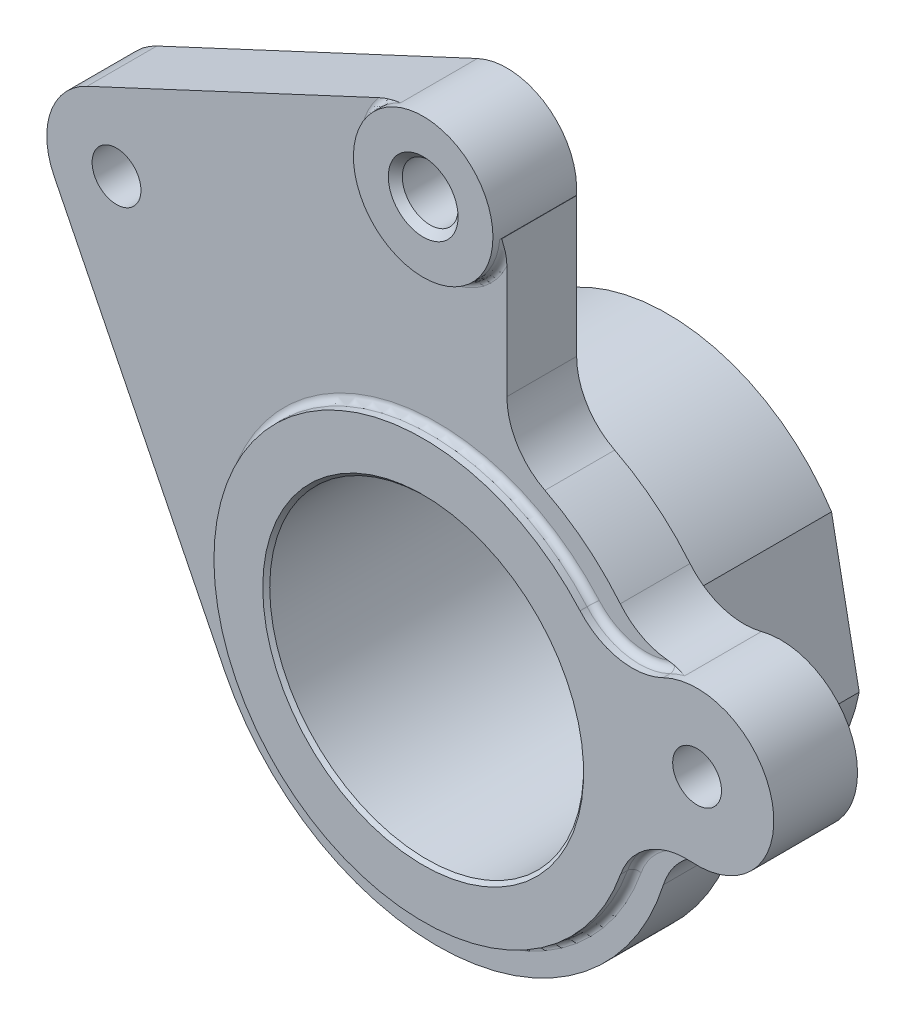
ISO-10303-21;
HEADER;
FILE_DESCRIPTION(('STEP AP214'),'2;1');
FILE_NAME('part.step','',(''),(''),'','','');
FILE_SCHEMA(('AUTOMOTIVE_DESIGN { 1 0 10303 214 1 1 1 1 }'));
ENDSEC;
DATA;
#1=APPLICATION_CONTEXT('core data for automotive mechanical design processes');
#2=APPLICATION_PROTOCOL_DEFINITION('international standard','automotive_design',2000,#1);
#3=PRODUCT_CONTEXT('',#1,'mechanical');
#4=PRODUCT('Part','Part','',(#3));
#5=PRODUCT_RELATED_PRODUCT_CATEGORY('part','',(#4));
#6=PRODUCT_DEFINITION_FORMATION('','',#4);
#7=PRODUCT_DEFINITION_CONTEXT('part definition',#1,'design');
#8=PRODUCT_DEFINITION('design','',#6,#7);
#9=PRODUCT_DEFINITION_SHAPE('','',#8);
#10=(LENGTH_UNIT() NAMED_UNIT(*) SI_UNIT(.MILLI.,.METRE.));
#11=(NAMED_UNIT(*) PLANE_ANGLE_UNIT() SI_UNIT($,.RADIAN.));
#12=(NAMED_UNIT(*) SI_UNIT($,.STERADIAN.) SOLID_ANGLE_UNIT());
#13=UNCERTAINTY_MEASURE_WITH_UNIT(LENGTH_MEASURE(1.E-05),#10,'distance_accuracy_value','');
#14=(GEOMETRIC_REPRESENTATION_CONTEXT(3) GLOBAL_UNCERTAINTY_ASSIGNED_CONTEXT((#13)) GLOBAL_UNIT_ASSIGNED_CONTEXT((#10,
#11,#12)) REPRESENTATION_CONTEXT('',''));
#15=CARTESIAN_POINT('',(0.,0.,0.));
#16=DIRECTION('',(0.,0.,1.));
#17=DIRECTION('',(1.,0.,0.));
#18=AXIS2_PLACEMENT_3D('',#15,#16,#17);
#19=CARTESIAN_POINT('',(-45.9626665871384,38.5672565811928,0.));
#20=DIRECTION('',(0.,0.,0.999999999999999));
#21=DIRECTION('',(1.,0.,0.));
#22=AXIS2_PLACEMENT_3D('',#19,#20,#21);
#23=PLANE('',#22);
#24=DIRECTION('',(-0.190808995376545,0.981627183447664,0.));
#25=VECTOR('',#24,1.);
#26=CARTESIAN_POINT('',(19.8018565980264,34.3901987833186,0.));
#27=LINE('',#26,#25);
#28=CARTESIAN_POINT('',(27.9732926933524,-7.64819559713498,2.22044604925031E-13));
#29=VERTEX_POINT('',#28);
#30=CARTESIAN_POINT('',(23.0713208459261,17.5702633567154,2.22044604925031E-13));
#31=VERTEX_POINT('',#30);
#32=EDGE_CURVE('E215',#29,#31,#27,.T.);
#33=ORIENTED_EDGE('',*,*,#32,.T.);
#34=CARTESIAN_POINT('',(-1.11022302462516E-13,0.,0.));
#35=DIRECTION('',(0.,0.,0.999999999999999));
#36=DIRECTION('',(1.,0.,0.));
#37=AXIS2_PLACEMENT_3D('',#34,#35,#36);
#38=CIRCLE('',#37,29.);
#39=EDGE_CURVE('E380',#31,#29,#38,.T.);
#40=ORIENTED_EDGE('',*,*,#39,.T.);
#41=EDGE_LOOP('',(#33,#40));
#42=FACE_BOUND('',#41,.T.);
#43=CARTESIAN_POINT('',(-1.11022302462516E-13,59.9999999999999,2.22044604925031E-13));
#44=DIRECTION('',(0.,0.,0.999999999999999));
#45=DIRECTION('',(1.,0.,0.));
#46=AXIS2_PLACEMENT_3D('',#43,#44,#45);
#47=CIRCLE('',#46,4.);
#48=CARTESIAN_POINT('',(-4.00000000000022,60.,2.20309881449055E-13));
#49=VERTEX_POINT('',#48);
#50=EDGE_CURVE('E253',#49,#49,#47,.T.);
#51=ORIENTED_EDGE('',*,*,#50,.T.);
#52=EDGE_LOOP('',(#51));
#53=FACE_BOUND('',#52,.T.);
#54=CARTESIAN_POINT('',(-45.9626665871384,38.5672565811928,0.));
#55=DIRECTION('',(0.,0.,0.999999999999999));
#56=DIRECTION('',(1.,0.,0.));
#57=AXIS2_PLACEMENT_3D('',#54,#55,#56);
#58=CIRCLE('',#57,3.5);
#59=CARTESIAN_POINT('',(-49.4626665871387,38.5672565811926,0.));
#60=VERTEX_POINT('',#59);
#61=EDGE_CURVE('E256',#60,#60,#58,.T.);
#62=ORIENTED_EDGE('',*,*,#61,.T.);
#63=EDGE_LOOP('',(#62));
#64=FACE_BOUND('',#63,.T.);
#65=CARTESIAN_POINT('',(20.,39.1918358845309,2.22044604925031E-13));
#66=DIRECTION('',(0.,0.,-0.999999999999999));
#67=DIRECTION('',(-1.,0.,0.));
#68=AXIS2_PLACEMENT_3D('',#65,#66,#67);
#69=CIRCLE('',#68,10.);
#70=CARTESIAN_POINT('',(15.4545454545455,30.2846004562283,0.));
#71=VERTEX_POINT('',#70);
#72=CARTESIAN_POINT('',(9.99999999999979,39.1918358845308,4.44089209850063E-13));
#73=VERTEX_POINT('',#72);
#74=EDGE_CURVE('E277',#71,#73,#69,.T.);
#75=ORIENTED_EDGE('',*,*,#74,.F.);
#76=CARTESIAN_POINT('',(-1.11022302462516E-13,0.,0.));
#77=DIRECTION('',(0.,0.,0.999999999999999));
#78=DIRECTION('',(1.,0.,0.));
#79=AXIS2_PLACEMENT_3D('',#76,#77,#78);
#80=CIRCLE('',#79,34.);
#81=CARTESIAN_POINT('',(26.2553768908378,21.602203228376,0.));
#82=VERTEX_POINT('',#81);
#83=EDGE_CURVE('E275',#82,#71,#80,.T.);
#84=ORIENTED_EDGE('',*,*,#83,.F.);
#85=CARTESIAN_POINT('',(33.9775465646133,27.9557924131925,0.));
#86=DIRECTION('',(0.,0.,-0.999999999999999));
#87=DIRECTION('',(1.,0.,0.));
#88=AXIS2_PLACEMENT_3D('',#85,#86,#87);
#89=CIRCLE('',#88,10.);
#90=CARTESIAN_POINT('',(36.4954231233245,18.2779673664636,0.));
#91=VERTEX_POINT('',#90);
#92=EDGE_CURVE('E273',#91,#82,#89,.T.);
#93=ORIENTED_EDGE('',*,*,#92,.F.);
#94=CARTESIAN_POINT('',(39.2650873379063,7.63235981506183,0.));
#95=DIRECTION('',(0.,0.,0.999999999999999));
#96=DIRECTION('',(1.,0.,0.));
#97=AXIS2_PLACEMENT_3D('',#94,#95,#96);
#98=CIRCLE('',#97,11.);
#99=CARTESIAN_POINT('',(40.6850141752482,-3.27561010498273,0.));
#100=VERTEX_POINT('',#99);
#101=EDGE_CURVE('E271',#100,#91,#98,.T.);
#102=ORIENTED_EDGE('',*,*,#101,.F.);
#103=CARTESIAN_POINT('',(41.9758567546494,-13.1919463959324,0.));
#104=DIRECTION('',(0.,0.,-0.999999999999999));
#105=DIRECTION('',(1.,0.,0.));
#106=AXIS2_PLACEMENT_3D('',#103,#104,#105);
#107=CIRCLE('',#106,10.);
#108=CARTESIAN_POINT('',(32.4358893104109,-10.1937767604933,2.22044604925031E-13));
#109=VERTEX_POINT('',#108);
#110=EDGE_CURVE('E269',#109,#100,#107,.T.);
#111=ORIENTED_EDGE('',*,*,#110,.F.);
#112=CARTESIAN_POINT('',(-1.11022302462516E-13,0.,0.));
#113=DIRECTION('',(0.,0.,0.999999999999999));
#114=DIRECTION('',(1.,0.,0.));
#115=AXIS2_PLACEMENT_3D('',#112,#113,#114);
#116=CIRCLE('',#115,34.);
#117=CARTESIAN_POINT('',(-30.4484399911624,-15.1291937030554,0.));
#118=VERTEX_POINT('',#117);
#119=EDGE_CURVE('E267',#118,#109,#116,.T.);
#120=ORIENTED_EDGE('',*,*,#119,.F.);
#121=DIRECTION('',(0.444976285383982,-0.895542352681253,0.));
#122=VECTOR('',#121,1.);
#123=CARTESIAN_POINT('',(-54.9180901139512,34.1174937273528,0.));
#124=LINE('',#123,#122);
#125=CARTESIAN_POINT('',(-54.9180901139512,34.1174937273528,0.));
#126=VERTEX_POINT('',#125);
#127=EDGE_CURVE('E265',#126,#118,#124,.T.);
#128=ORIENTED_EDGE('',*,*,#127,.F.);
#129=CARTESIAN_POINT('',(-45.9626665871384,38.5672565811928,0.));
#130=DIRECTION('',(0.,0.,0.999999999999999));
#131=DIRECTION('',(1.,0.,0.));
#132=AXIS2_PLACEMENT_3D('',#129,#130,#131);
#133=CIRCLE('',#132,10.);
#134=CARTESIAN_POINT('',(-50.1888492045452,47.630334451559,-2.22044604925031E-13));
#135=VERTEX_POINT('',#134);
#136=EDGE_CURVE('E262',#135,#126,#133,.T.);
#137=ORIENTED_EDGE('',*,*,#136,.F.);
#138=DIRECTION('',(-0.906307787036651,-0.422618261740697,0.));
#139=VECTOR('',#138,1.);
#140=CARTESIAN_POINT('',(-50.1888492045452,47.630334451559,-2.22044604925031E-13));
#141=LINE('',#140,#139);
#142=CARTESIAN_POINT('',(-4.22618261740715,69.0630778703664,0.));
#143=VERTEX_POINT('',#142);
#144=EDGE_CURVE('E285',#143,#135,#141,.T.);
#145=ORIENTED_EDGE('',*,*,#144,.F.);
#146=CARTESIAN_POINT('',(-1.11022302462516E-13,59.9999999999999,2.22044604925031E-13));
#147=DIRECTION('',(0.,0.,0.999999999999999));
#148=DIRECTION('',(1.,0.,0.));
#149=AXIS2_PLACEMENT_3D('',#146,#147,#148);
#150=CIRCLE('',#149,9.99999999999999);
#151=CARTESIAN_POINT('',(9.96521728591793,59.1666666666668,0.));
#152=VERTEX_POINT('',#151);
#153=EDGE_CURVE('E283',#152,#143,#150,.T.);
#154=ORIENTED_EDGE('',*,*,#153,.F.);
#155=CARTESIAN_POINT('',(-1.11022302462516E-13,0.,0.));
#156=DIRECTION('',(0.,0.,0.999999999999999));
#157=DIRECTION('',(1.,0.,0.));
#158=AXIS2_PLACEMENT_3D('',#155,#156,#157);
#159=CIRCLE('',#158,60.);
#160=CARTESIAN_POINT('',(10.,59.1607978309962,-2.22044604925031E-13));
#161=VERTEX_POINT('',#160);
#162=EDGE_CURVE('E281',#161,#152,#159,.T.);
#163=ORIENTED_EDGE('',*,*,#162,.F.);
#164=DIRECTION('',(0.,1.,0.));
#165=VECTOR('',#164,1.);
#166=CARTESIAN_POINT('',(10.,59.1607978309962,-2.22044604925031E-13));
#167=LINE('',#166,#165);
#168=EDGE_CURVE('E279',#73,#161,#167,.T.);
#169=ORIENTED_EDGE('',*,*,#168,.F.);
#170=EDGE_LOOP('',(#75,#84,#93,#102,#111,#120,#128,#137,#145,#154,#163,#169));
#171=FACE_BOUND('',#170,.T.);
#172=CARTESIAN_POINT('',(39.2650873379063,7.63235981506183,0.));
#173=DIRECTION('',(0.,0.,0.999999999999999));
#174=DIRECTION('',(1.,0.,0.));
#175=AXIS2_PLACEMENT_3D('',#172,#173,#174);
#176=CIRCLE('',#175,3.5);
#177=CARTESIAN_POINT('',(35.7650873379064,7.63235981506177,0.));
#178=VERTEX_POINT('',#177);
#179=EDGE_CURVE('E250',#178,#178,#176,.T.);
#180=ORIENTED_EDGE('',*,*,#179,.T.);
#181=EDGE_LOOP('',(#180));
#182=FACE_BOUND('',#181,.T.);
#183=ADVANCED_FACE('F36',(#42,#53,#64,#171,#182),#23,.F.);
#184=CARTESIAN_POINT('',(-45.9626665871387,38.5672565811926,10.0000000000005));
#185=DIRECTION('',(0.,0.,0.999999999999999));
#186=DIRECTION('',(1.,0.,0.));
#187=AXIS2_PLACEMENT_3D('',#184,#185,#186);
#188=PLANE('',#187);
#189=CARTESIAN_POINT('',(-45.9626665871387,38.5672565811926,10.0000000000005));
#190=DIRECTION('',(0.,0.,0.999999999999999));
#191=DIRECTION('',(1.,0.,0.));
#192=AXIS2_PLACEMENT_3D('',#189,#190,#191);
#193=CIRCLE('',#192,3.5);
#194=CARTESIAN_POINT('',(-49.4626665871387,38.5672565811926,10.0000000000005));
#195=VERTEX_POINT('',#194);
#196=EDGE_CURVE('E259',#195,#195,#193,.T.);
#197=ORIENTED_EDGE('',*,*,#196,.F.);
#198=EDGE_LOOP('',(#197));
#199=FACE_BOUND('',#198,.T.);
#200=DIRECTION('',(0.,1.,0.));
#201=VECTOR('',#200,1.);
#202=CARTESIAN_POINT('',(9.99999999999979,59.1607978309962,10.0000000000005));
#203=LINE('',#202,#201);
#204=CARTESIAN_POINT('',(10.0000000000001,39.1918358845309,10.));
#205=VERTEX_POINT('',#204);
#206=CARTESIAN_POINT('',(9.99999999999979,55.4174243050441,10.0000000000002));
#207=VERTEX_POINT('',#206);
#208=EDGE_CURVE('E303',#205,#207,#203,.T.);
#209=ORIENTED_EDGE('',*,*,#208,.T.);
#210=CARTESIAN_POINT('',(-2.22044604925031E-13,60.,10.));
#211=DIRECTION('',(0.,0.,0.999999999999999));
#212=DIRECTION('',(1.,0.,0.));
#213=AXIS2_PLACEMENT_3D('',#210,#211,#212);
#214=CIRCLE('',#213,11.);
#215=CARTESIAN_POINT('',(-8.37940665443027,67.126397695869,10.0000000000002));
#216=VERTEX_POINT('',#215);
#217=EDGE_CURVE('E374',#207,#216,#214,.F.);
#218=ORIENTED_EDGE('',*,*,#217,.T.);
#219=DIRECTION('',(-0.906307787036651,-0.422618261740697,0.));
#220=VECTOR('',#219,1.);
#221=CARTESIAN_POINT('',(-50.1888492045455,47.630334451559,10.0000000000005));
#222=LINE('',#221,#220);
#223=CARTESIAN_POINT('',(-50.1888492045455,47.630334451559,10.0000000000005));
#224=VERTEX_POINT('',#223);
#225=EDGE_CURVE('E306',#216,#224,#222,.T.);
#226=ORIENTED_EDGE('',*,*,#225,.T.);
#227=CARTESIAN_POINT('',(-45.9626665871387,38.5672565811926,10.0000000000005));
#228=DIRECTION('',(0.,0.,0.999999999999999));
#229=DIRECTION('',(1.,0.,0.));
#230=AXIS2_PLACEMENT_3D('',#227,#228,#229);
#231=CIRCLE('',#230,10.);
#232=CARTESIAN_POINT('',(-54.918090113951,34.1174937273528,10.0000000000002));
#233=VERTEX_POINT('',#232);
#234=EDGE_CURVE('E287',#224,#233,#231,.T.);
#235=ORIENTED_EDGE('',*,*,#234,.T.);
#236=DIRECTION('',(0.444976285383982,-0.895542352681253,0.));
#237=VECTOR('',#236,1.);
#238=CARTESIAN_POINT('',(-54.918090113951,34.1174937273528,10.0000000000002));
#239=LINE('',#238,#237);
#240=CARTESIAN_POINT('',(-30.4484399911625,-15.1291937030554,10.0000000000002));
#241=VERTEX_POINT('',#240);
#242=EDGE_CURVE('E290',#233,#241,#239,.T.);
#243=ORIENTED_EDGE('',*,*,#242,.T.);
#244=CARTESIAN_POINT('',(0.,0.,10.0000000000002));
#245=DIRECTION('',(0.,0.,0.999999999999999));
#246=DIRECTION('',(1.,0.,0.));
#247=AXIS2_PLACEMENT_3D('',#244,#245,#246);
#248=CIRCLE('',#247,34.);
#249=CARTESIAN_POINT('',(32.4358893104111,-10.1937767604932,10.));
#250=VERTEX_POINT('',#249);
#251=EDGE_CURVE('E292',#241,#250,#248,.T.);
#252=ORIENTED_EDGE('',*,*,#251,.T.);
#253=CARTESIAN_POINT('',(41.9758567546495,-13.1919463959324,10.0000000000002));
#254=DIRECTION('',(0.,0.,-0.999999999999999));
#255=DIRECTION('',(1.,0.,0.));
#256=AXIS2_PLACEMENT_3D('',#253,#254,#255);
#257=CIRCLE('',#256,10.);
#258=CARTESIAN_POINT('',(37.3663017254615,-4.31771389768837,10.0000000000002));
#259=VERTEX_POINT('',#258);
#260=EDGE_CURVE('E294',#250,#259,#257,.T.);
#261=ORIENTED_EDGE('',*,*,#260,.T.);
#262=CARTESIAN_POINT('',(37.7203392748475,-13.3107477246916,10.0000000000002));
#263=DIRECTION('',(0.,0.,0.999999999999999));
#264=DIRECTION('',(1.,0.,0.));
#265=AXIS2_PLACEMENT_3D('',#262,#263,#264);
#266=CIRCLE('',#265,9.);
#267=CARTESIAN_POINT('',(29.2332629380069,-10.315829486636,10.0000000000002));
#268=VERTEX_POINT('',#267);
#269=EDGE_CURVE('E370',#259,#268,#266,.T.);
#270=ORIENTED_EDGE('',*,*,#269,.T.);
#271=CARTESIAN_POINT('',(0.,0.,10.0000000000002));
#272=DIRECTION('',(0.,0.,0.999999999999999));
#273=DIRECTION('',(1.,0.,0.));
#274=AXIS2_PLACEMENT_3D('',#271,#272,#273);
#275=CIRCLE('',#274,31.);
#276=CARTESIAN_POINT('',(23.2402316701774,20.5156435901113,10.0000000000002));
#277=VERTEX_POINT('',#276);
#278=EDGE_CURVE('E368',#268,#277,#275,.F.);
#279=ORIENTED_EDGE('',*,*,#278,.T.);
#280=CARTESIAN_POINT('',(29.987395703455,26.4717981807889,10.));
#281=DIRECTION('',(0.,0.,0.999999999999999));
#282=DIRECTION('',(1.,0.,0.));
#283=AXIS2_PLACEMENT_3D('',#280,#281,#282);
#284=CIRCLE('',#283,9.);
#285=CARTESIAN_POINT('',(33.0279875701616,18.0009776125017,10.));
#286=VERTEX_POINT('',#285);
#287=EDGE_CURVE('E372',#277,#286,#284,.T.);
#288=ORIENTED_EDGE('',*,*,#287,.T.);
#289=CARTESIAN_POINT('',(33.9775465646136,27.9557924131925,10.0000000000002));
#290=DIRECTION('',(0.,0.,-0.999999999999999));
#291=DIRECTION('',(1.,0.,0.));
#292=AXIS2_PLACEMENT_3D('',#289,#290,#291);
#293=CIRCLE('',#292,10.);
#294=CARTESIAN_POINT('',(26.2553768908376,21.6022032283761,10.));
#295=VERTEX_POINT('',#294);
#296=EDGE_CURVE('E297',#286,#295,#293,.T.);
#297=ORIENTED_EDGE('',*,*,#296,.T.);
#298=CARTESIAN_POINT('',(0.,0.,10.0000000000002));
#299=DIRECTION('',(0.,0.,0.999999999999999));
#300=DIRECTION('',(1.,0.,0.));
#301=AXIS2_PLACEMENT_3D('',#298,#299,#300);
#302=CIRCLE('',#301,34.);
#303=CARTESIAN_POINT('',(15.4545454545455,30.2846004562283,10.0000000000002));
#304=VERTEX_POINT('',#303);
#305=EDGE_CURVE('E299',#295,#304,#302,.T.);
#306=ORIENTED_EDGE('',*,*,#305,.T.);
#307=CARTESIAN_POINT('',(19.9999999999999,39.1918358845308,10.0000000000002));
#308=DIRECTION('',(0.,0.,-0.999999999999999));
#309=DIRECTION('',(-1.,0.,0.));
#310=AXIS2_PLACEMENT_3D('',#307,#308,#309);
#311=CIRCLE('',#310,10.);
#312=EDGE_CURVE('E301',#304,#205,#311,.T.);
#313=ORIENTED_EDGE('',*,*,#312,.T.);
#314=EDGE_LOOP('',(#209,#218,#226,#235,#243,#252,#261,#270,#279,#288,#297,#306,#313));
#315=FACE_BOUND('',#314,.T.);
#316=ADVANCED_FACE('F482',(#199,#315),#188,.T.);
#317=CARTESIAN_POINT('',(-45.9626665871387,38.5672565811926,10.0000000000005));
#318=DIRECTION('',(0.,0.,-0.999999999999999));
#319=DIRECTION('',(-1.,0.,0.));
#320=AXIS2_PLACEMENT_3D('',#317,#318,#319);
#321=CYLINDRICAL_SURFACE('',#320,10.);
#322=ORIENTED_EDGE('',*,*,#136,.T.);
#323=DIRECTION('',(0.,0.,-0.999999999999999));
#324=VECTOR('',#323,1.);
#325=CARTESIAN_POINT('',(-54.918090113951,34.1174937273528,10.0000000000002));
#326=LINE('',#325,#324);
#327=EDGE_CURVE('E339',#233,#126,#326,.T.);
#328=ORIENTED_EDGE('',*,*,#327,.F.);
#329=ORIENTED_EDGE('',*,*,#234,.F.);
#330=DIRECTION('',(0.,0.,-0.999999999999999));
#331=VECTOR('',#330,1.);
#332=CARTESIAN_POINT('',(-50.1888492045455,47.630334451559,10.0000000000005));
#333=LINE('',#332,#331);
#334=EDGE_CURVE('E308',#224,#135,#333,.T.);
#335=ORIENTED_EDGE('',*,*,#334,.T.);
#336=EDGE_LOOP('',(#322,#328,#329,#335));
#337=FACE_BOUND('',#336,.T.);
#338=ADVANCED_FACE('F38',(#337),#321,.T.);
#339=CARTESIAN_POINT('',(-54.918090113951,34.1174937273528,10.0000000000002));
#340=DIRECTION('',(0.895542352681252,0.444976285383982,0.));
#341=DIRECTION('',(-0.444976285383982,0.895542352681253,0.));
#342=AXIS2_PLACEMENT_3D('',#339,#340,#341);
#343=PLANE('',#342);
#344=ORIENTED_EDGE('',*,*,#127,.T.);
#345=DIRECTION('',(0.,0.,-0.999999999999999));
#346=VECTOR('',#345,1.);
#347=CARTESIAN_POINT('',(-30.4484399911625,-15.1291937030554,10.0000000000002));
#348=LINE('',#347,#346);
#349=EDGE_CURVE('E336',#241,#118,#348,.T.);
#350=ORIENTED_EDGE('',*,*,#349,.F.);
#351=ORIENTED_EDGE('',*,*,#242,.F.);
#352=ORIENTED_EDGE('',*,*,#327,.T.);
#353=EDGE_LOOP('',(#344,#350,#351,#352));
#354=FACE_BOUND('',#353,.T.);
#355=ADVANCED_FACE('F744',(#354),#343,.F.);
#356=CARTESIAN_POINT('',(0.,0.,10.0000000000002));
#357=DIRECTION('',(0.,0.,-0.999999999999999));
#358=DIRECTION('',(-1.,0.,0.));
#359=AXIS2_PLACEMENT_3D('',#356,#357,#358);
#360=CYLINDRICAL_SURFACE('',#359,34.);
#361=ORIENTED_EDGE('',*,*,#119,.T.);
#362=DIRECTION('',(0.,0.,-0.999999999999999));
#363=VECTOR('',#362,1.);
#364=CARTESIAN_POINT('',(32.4358893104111,-10.1937767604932,10.));
#365=LINE('',#364,#363);
#366=EDGE_CURVE('E333',#250,#109,#365,.T.);
#367=ORIENTED_EDGE('',*,*,#366,.F.);
#368=ORIENTED_EDGE('',*,*,#251,.F.);
#369=ORIENTED_EDGE('',*,*,#349,.T.);
#370=EDGE_LOOP('',(#361,#367,#368,#369));
#371=FACE_BOUND('',#370,.T.);
#372=ADVANCED_FACE('F751',(#371),#360,.T.);
#373=CARTESIAN_POINT('',(41.9758567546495,-13.1919463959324,10.0000000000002));
#374=DIRECTION('',(0.,0.,-0.999999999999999));
#375=DIRECTION('',(-1.,0.,0.));
#376=AXIS2_PLACEMENT_3D('',#373,#374,#375);
#377=CYLINDRICAL_SURFACE('',#376,10.);
#378=ORIENTED_EDGE('',*,*,#110,.T.);
#379=DIRECTION('',(0.,0.,-0.999999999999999));
#380=VECTOR('',#379,1.);
#381=CARTESIAN_POINT('',(40.6850141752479,-3.27561010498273,10.0000000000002));
#382=LINE('',#381,#380);
#383=CARTESIAN_POINT('',(40.6850141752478,-3.27561010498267,11.0000000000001));
#384=VERTEX_POINT('',#383);
#385=EDGE_CURVE('E330',#384,#100,#382,.T.);
#386=ORIENTED_EDGE('',*,*,#385,.F.);
#387=CARTESIAN_POINT('',(40.6850141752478,-3.27561010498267,11.0000000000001));
#388=CARTESIAN_POINT('',(40.680629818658,-3.27618083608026,10.9980681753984));
#389=CARTESIAN_POINT('',(40.6762458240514,-3.27675447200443,10.9961363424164));
#390=CARTESIAN_POINT('',(40.5194687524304,-3.29737401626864,10.9270465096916));
#391=CARTESIAN_POINT('',(40.3675063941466,-3.3209295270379,10.8599062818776));
#392=CARTESIAN_POINT('',(40.0639462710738,-3.37520657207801,10.7275792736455));
#393=CARTESIAN_POINT('',(39.9123486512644,-3.40593059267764,10.6623931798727));
#394=CARTESIAN_POINT('',(39.6092736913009,-3.47477547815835,10.536145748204));
#395=CARTESIAN_POINT('',(39.4577963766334,-3.51288915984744,10.4750804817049));
#396=CARTESIAN_POINT('',(39.1545534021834,-3.59689677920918,10.3594760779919));
#397=CARTESIAN_POINT('',(39.0027879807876,-3.64278585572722,10.3049328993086));
#398=CARTESIAN_POINT('',(38.7788560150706,-3.71645589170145,10.2316454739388));
#399=CARTESIAN_POINT('',(38.7068546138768,-3.74104862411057,10.2091737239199));
#400=CARTESIAN_POINT('',(38.5627292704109,-3.7921374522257,10.166793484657));
#401=CARTESIAN_POINT('',(38.4906052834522,-3.81863454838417,10.1468863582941));
#402=CARTESIAN_POINT('',(38.4184445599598,-3.84610141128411,10.1284784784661));
#403=B_SPLINE_CURVE_WITH_KNOTS('',3,(#387,#388,#389,#390,#391,#392,#393,#394,#395,#396,#397,
#398,#399,#400,#401,#402),.UNSPECIFIED.,.F.,.F.,(4,2,2,2,2,2,2,4),(0.,0.0144749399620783,
0.517683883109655,1.02106761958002,1.52396446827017,2.02654805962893,2.26449485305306,
2.50256757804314),.UNSPECIFIED.);
#404=CARTESIAN_POINT('',(38.4184445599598,-3.84610141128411,10.1284784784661));
#405=VERTEX_POINT('',#404);
#406=EDGE_CURVE('E64',#384,#405,#403,.T.);
#407=ORIENTED_EDGE('',*,*,#406,.T.);
#408=CARTESIAN_POINT('',(38.4702522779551,-3.82654532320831,10.1420923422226));
#409=CARTESIAN_POINT('',(38.4239463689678,-3.84387751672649,10.1295646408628));
#410=CARTESIAN_POINT('',(38.3775512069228,-3.86163626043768,10.1179948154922));
#411=CARTESIAN_POINT('',(38.2846830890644,-3.89798492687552,10.0966485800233));
#412=CARTESIAN_POINT('',(38.238210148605,-3.91657470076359,10.086871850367));
#413=CARTESIAN_POINT('',(38.0992378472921,-3.973388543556,10.0601258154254));
#414=CARTESIAN_POINT('',(38.0067478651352,-4.01282049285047,10.0456252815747));
#415=CARTESIAN_POINT('',(37.8224978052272,-4.09470733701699,10.0226320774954));
#416=CARTESIAN_POINT('',(37.7307370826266,-4.13715912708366,10.0141333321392));
#417=CARTESIAN_POINT('',(37.5478373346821,-4.22517272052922,10.0028234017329));
#418=CARTESIAN_POINT('',(37.4567031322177,-4.27074797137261,10.0000386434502));
#419=CARTESIAN_POINT('',(37.3663017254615,-4.31771389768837,10.0000000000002));
#420=B_SPLINE_CURVE_WITH_KNOTS('',3,(#408,#409,#410,#411,#412,#413,#414,#415,#416,#417,#418,
#419),.UNSPECIFIED.,.F.,.F.,(4,2,2,2,2,4),(0.,0.152990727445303,0.305954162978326,
0.610442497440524,0.914622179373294,1.22020552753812),.UNSPECIFIED.);
#421=EDGE_CURVE('E426',#405,#259,#420,.T.);
#422=ORIENTED_EDGE('',*,*,#421,.T.);
#423=ORIENTED_EDGE('',*,*,#260,.F.);
#424=ORIENTED_EDGE('',*,*,#366,.T.);
#425=EDGE_LOOP('',(#378,#386,#407,#422,#423,#424));
#426=FACE_BOUND('',#425,.T.);
#427=ADVANCED_FACE('F437',(#426),#377,.F.);
#428=CARTESIAN_POINT('',(39.2650873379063,7.63235981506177,10.0000000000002));
#429=DIRECTION('',(0.,0.,-0.999999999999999));
#430=DIRECTION('',(-1.,0.,0.));
#431=AXIS2_PLACEMENT_3D('',#428,#429,#430);
#432=CYLINDRICAL_SURFACE('',#431,11.);
#433=DIRECTION('',(0.,0.,-0.999999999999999));
#434=VECTOR('',#433,1.);
#435=CARTESIAN_POINT('',(36.4954231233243,18.2779673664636,10.0000000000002));
#436=LINE('',#435,#434);
#437=CARTESIAN_POINT('',(36.4954231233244,18.2779673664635,11.0000000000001));
#438=VERTEX_POINT('',#437);
#439=EDGE_CURVE('E327',#438,#91,#436,.T.);
#440=ORIENTED_EDGE('',*,*,#439,.F.);
#441=CARTESIAN_POINT('',(39.2650873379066,7.63235981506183,11.0000000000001));
#442=DIRECTION('',(0.,0.,0.999999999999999));
#443=DIRECTION('',(1.,0.,0.));
#444=AXIS2_PLACEMENT_3D('',#441,#442,#443);
#445=CIRCLE('',#444,11.);
#446=CARTESIAN_POINT('',(34.4053441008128,17.5006370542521,11.0000000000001));
#447=VERTEX_POINT('',#446);
#448=EDGE_CURVE('E363',#438,#447,#445,.T.);
#449=ORIENTED_EDGE('',*,*,#448,.T.);
#450=DIRECTION('',(0.,0.,-0.999999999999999));
#451=VECTOR('',#450,1.);
#452=CARTESIAN_POINT('',(34.4053441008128,17.5006370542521,12.0000000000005));
#453=LINE('',#452,#451);
#454=CARTESIAN_POINT('',(34.4053441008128,17.5006370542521,12.0000000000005));
#455=VERTEX_POINT('',#454);
#456=EDGE_CURVE('E234',#455,#447,#453,.T.);
#457=ORIENTED_EDGE('',*,*,#456,.F.);
#458=CARTESIAN_POINT('',(39.2650873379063,7.63235981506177,12.0000000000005));
#459=DIRECTION('',(0.,0.,0.999999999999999));
#460=DIRECTION('',(1.,0.,0.));
#461=AXIS2_PLACEMENT_3D('',#458,#459,#460);
#462=CIRCLE('',#461,11.);
#463=CARTESIAN_POINT('',(38.4559335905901,-3.33783937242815,12.));
#464=VERTEX_POINT('',#463);
#465=EDGE_CURVE('E232',#464,#455,#462,.T.);
#466=ORIENTED_EDGE('',*,*,#465,.F.);
#467=DIRECTION('',(0.,0.,-0.999999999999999));
#468=VECTOR('',#467,1.);
#469=CARTESIAN_POINT('',(38.4559335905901,-3.33783937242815,12.));
#470=LINE('',#469,#468);
#471=CARTESIAN_POINT('',(38.4559335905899,-3.3378393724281,11.0000000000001));
#472=VERTEX_POINT('',#471);
#473=EDGE_CURVE('E237',#464,#472,#470,.T.);
#474=ORIENTED_EDGE('',*,*,#473,.T.);
#475=CARTESIAN_POINT('',(39.2650873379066,7.63235981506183,11.0000000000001));
#476=DIRECTION('',(0.,0.,0.999999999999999));
#477=DIRECTION('',(1.,0.,0.));
#478=AXIS2_PLACEMENT_3D('',#475,#476,#477);
#479=CIRCLE('',#478,11.);
#480=EDGE_CURVE('E208',#472,#384,#479,.T.);
#481=ORIENTED_EDGE('',*,*,#480,.T.);
#482=ORIENTED_EDGE('',*,*,#385,.T.);
#483=ORIENTED_EDGE('',*,*,#101,.T.);
#484=EDGE_LOOP('',(#440,#449,#457,#466,#474,#481,#482,#483));
#485=FACE_BOUND('',#484,.T.);
#486=ADVANCED_FACE('F585',(#485),#432,.T.);
#487=CARTESIAN_POINT('',(33.9775465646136,27.9557924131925,10.0000000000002));
#488=DIRECTION('',(0.,0.,-0.999999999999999));
#489=DIRECTION('',(-1.,0.,0.));
#490=AXIS2_PLACEMENT_3D('',#487,#488,#489);
#491=CYLINDRICAL_SURFACE('',#490,10.);
#492=ORIENTED_EDGE('',*,*,#296,.F.);
#493=CARTESIAN_POINT('',(33.0279875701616,18.0009776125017,10.));
#494=CARTESIAN_POINT('',(33.0921410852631,17.9948579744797,10.0000043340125));
#495=CARTESIAN_POINT('',(33.1563431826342,17.9893602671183,10.0011281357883));
#496=CARTESIAN_POINT('',(33.2847636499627,17.9796107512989,10.0056531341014));
#497=CARTESIAN_POINT('',(33.3489820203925,17.9753589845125,10.0090544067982));
#498=CARTESIAN_POINT('',(33.5404655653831,17.9645365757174,10.022656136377));
#499=CARTESIAN_POINT('',(33.6676296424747,17.9597970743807,10.0362536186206));
#500=CARTESIAN_POINT('',(33.8574667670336,17.9563118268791,10.0641270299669));
#501=CARTESIAN_POINT('',(33.9206791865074,17.9557557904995,10.0746837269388));
#502=CARTESIAN_POINT('',(34.0465903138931,17.9558327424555,10.0984883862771));
#503=CARTESIAN_POINT('',(34.1092891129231,17.9564655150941,10.111735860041));
#504=CARTESIAN_POINT('',(34.2344871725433,17.9588965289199,10.141283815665));
#505=CARTESIAN_POINT('',(34.2969806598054,17.9607042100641,10.1576082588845));
#506=CARTESIAN_POINT('',(34.4209791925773,17.9654350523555,10.1936425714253));
#507=CARTESIAN_POINT('',(34.4824835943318,17.9683589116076,10.2133545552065));
#508=CARTESIAN_POINT('',(34.5433189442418,17.9718101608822,10.2349525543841));
#509=B_SPLINE_CURVE_WITH_KNOTS('',3,(#493,#494,#495,#496,#497,#498,#499,#500,#501,#502,#503,
#504,#505,#506,#507,#508),.UNSPECIFIED.,.F.,.F.,(4,2,2,2,2,2,2,4),(0.,0.193299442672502,
0.386605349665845,0.770000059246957,0.962218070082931,1.15440120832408,1.34814788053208,
1.5420159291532),.UNSPECIFIED.);
#510=CARTESIAN_POINT('',(34.1801865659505,17.9578457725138,10.1284784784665));
#511=VERTEX_POINT('',#510);
#512=EDGE_CURVE('E421',#286,#511,#509,.T.);
#513=ORIENTED_EDGE('',*,*,#512,.T.);
#514=CARTESIAN_POINT('',(36.4954231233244,18.2779673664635,11.0000000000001));
#515=CARTESIAN_POINT('',(36.4954231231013,18.2779673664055,11.0000011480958));
#516=CARTESIAN_POINT('',(36.495422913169,18.277967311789,11.0000022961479));
#517=CARTESIAN_POINT('',(36.4954222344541,18.2779671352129,11.000004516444));
#518=CARTESIAN_POINT('',(36.4954217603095,18.2779670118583,11.0000055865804));
#519=CARTESIAN_POINT('',(36.4954206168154,18.2779667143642,11.0000077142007));
#520=CARTESIAN_POINT('',(36.4954199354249,18.2779665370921,11.0000087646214));
#521=CARTESIAN_POINT('',(36.4954184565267,18.2779661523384,11.0000107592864));
#522=CARTESIAN_POINT('',(36.4954176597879,18.277965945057,11.0000117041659));
#523=CARTESIAN_POINT('',(36.4954148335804,18.2779652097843,11.0000148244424));
#524=CARTESIAN_POINT('',(36.495412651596,18.2779646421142,11.0000168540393));
#525=CARTESIAN_POINT('',(36.4954081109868,18.2779634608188,11.0000205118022));
#526=CARTESIAN_POINT('',(36.495405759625,18.2779628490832,11.0000221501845));
#527=CARTESIAN_POINT('',(36.4953967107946,18.2779604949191,11.0000281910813));
#528=CARTESIAN_POINT('',(36.4953898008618,18.277958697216,11.0000322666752));
#529=CARTESIAN_POINT('',(36.4953760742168,18.2779551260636,11.0000390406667));
#530=CARTESIAN_POINT('',(36.4953692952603,18.2779533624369,11.0000418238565));
#531=CARTESIAN_POINT('',(36.4953407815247,18.2779459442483,11.0000534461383));
#532=CARTESIAN_POINT('',(36.4953189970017,18.2779402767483,11.0000621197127));
#533=CARTESIAN_POINT('',(36.4952780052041,18.2779296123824,11.0000762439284));
#534=CARTESIAN_POINT('',(36.4952588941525,18.2779246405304,11.0000819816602));
#535=CARTESIAN_POINT('',(36.4951215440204,18.2778889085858,11.0001268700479));
#536=CARTESIAN_POINT('',(36.4950094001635,18.2778597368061,11.0001833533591));
#537=CARTESIAN_POINT('',(36.4945755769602,18.2777468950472,11.0003937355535));
#538=CARTESIAN_POINT('',(36.4942496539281,18.2776621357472,11.0005347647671));
#539=CARTESIAN_POINT('',(36.4929919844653,18.277335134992,11.0010871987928));
#540=CARTESIAN_POINT('',(36.4920645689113,18.2770941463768,11.0015120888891));
#541=CARTESIAN_POINT('',(36.4882896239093,18.2761138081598,11.0032331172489));
#542=CARTESIAN_POINT('',(36.4854370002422,18.2753743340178,11.0045141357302));
#543=CARTESIAN_POINT('',(36.401484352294,18.2536511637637,11.0422209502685));
#544=CARTESIAN_POINT('',(36.3201996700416,18.2337039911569,11.078907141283));
#545=CARTESIAN_POINT('',(36.1599243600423,18.1965024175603,11.1504903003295));
#546=CARTESIAN_POINT('',(36.080957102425,18.1791767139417,11.1854039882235));
#547=CARTESIAN_POINT('',(35.9133360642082,18.1445304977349,11.2586367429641));
#548=CARTESIAN_POINT('',(35.824605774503,18.1274364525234,11.2968894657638));
#549=CARTESIAN_POINT('',(35.6453537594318,18.0954278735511,11.3726212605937));
#550=CARTESIAN_POINT('',(35.5548229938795,18.0805367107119,11.410088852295));
#551=CARTESIAN_POINT('',(35.3953961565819,18.0565760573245,11.4742862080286));
#552=CARTESIAN_POINT('',(35.3267213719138,18.0469799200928,11.5013682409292));
#553=CARTESIAN_POINT('',(35.1889245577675,18.0291929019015,11.5543378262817));
#554=CARTESIAN_POINT('',(35.1198039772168,18.0209987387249,11.5802280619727));
#555=CARTESIAN_POINT('',(34.9143488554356,17.9988291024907,11.6548281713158));
#556=CARTESIAN_POINT('',(34.7770811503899,17.9868387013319,11.7016293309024));
#557=CARTESIAN_POINT('',(34.5465602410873,17.9715693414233,11.7734518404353));
#558=CARTESIAN_POINT('',(34.4540411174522,17.9667166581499,11.8005023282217));
#559=CARTESIAN_POINT('',(34.2673487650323,17.9595538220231,11.8508017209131));
#560=CARTESIAN_POINT('',(34.1731694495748,17.9572569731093,11.8740302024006));
#561=CARTESIAN_POINT('',(33.978969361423,17.9552980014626,11.9166518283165));
#562=CARTESIAN_POINT('',(33.8788914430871,17.9557729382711,11.9357960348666));
#563=CARTESIAN_POINT('',(33.6779035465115,17.959778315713,11.9673946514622));
#564=CARTESIAN_POINT('',(33.5769953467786,17.9633033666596,11.9798607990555));
#565=CARTESIAN_POINT('',(33.350558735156,17.974680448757,11.998548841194));
#566=CARTESIAN_POINT('',(33.2248713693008,17.9833609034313,12.0025863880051));
#567=CARTESIAN_POINT('',(32.9757140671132,18.0053298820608,11.994142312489));
#568=CARTESIAN_POINT('',(32.8522356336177,18.0185617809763,11.9818586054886));
#569=CARTESIAN_POINT('',(32.6478740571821,18.0442321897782,11.9432864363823));
#570=CARTESIAN_POINT('',(32.5658156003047,18.055609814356,11.9226221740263));
#571=CARTESIAN_POINT('',(32.4056363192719,18.0797801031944,11.8693189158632));
#572=CARTESIAN_POINT('',(32.3275183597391,18.0925737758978,11.8366713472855));
#573=CARTESIAN_POINT('',(32.1985281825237,18.1151528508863,11.7680940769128));
#574=CARTESIAN_POINT('',(32.1459465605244,18.1248304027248,11.7353627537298));
#575=CARTESIAN_POINT('',(32.0466285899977,18.1438559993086,11.6619106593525));
#576=CARTESIAN_POINT('',(31.9998819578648,18.1532046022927,11.6212042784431));
#577=CARTESIAN_POINT('',(31.923080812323,18.169046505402,11.5406902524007));
#578=CARTESIAN_POINT('',(31.8915574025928,18.1757370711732,11.5023285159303));
#579=CARTESIAN_POINT('',(31.8351161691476,18.1879458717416,11.4208069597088));
#580=CARTESIAN_POINT('',(31.8101963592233,18.1934644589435,11.3776485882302));
#581=CARTESIAN_POINT('',(31.7682085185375,18.2028801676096,11.287060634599));
#582=CARTESIAN_POINT('',(31.7512007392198,18.2067648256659,11.2396014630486));
#583=CARTESIAN_POINT('',(31.7265083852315,18.2124360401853,11.1421930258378));
#584=CARTESIAN_POINT('',(31.7188167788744,18.2142241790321,11.0922456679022));
#585=CARTESIAN_POINT('',(31.7136706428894,18.2154192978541,10.9981809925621));
#586=CARTESIAN_POINT('',(31.7150411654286,18.2150995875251,10.9541279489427));
#587=CARTESIAN_POINT('',(31.7252231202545,18.2127402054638,10.8669484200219));
#588=CARTESIAN_POINT('',(31.7340330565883,18.2107008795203,10.8238217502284));
#589=CARTESIAN_POINT('',(31.7582076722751,18.2051677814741,10.7410032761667));
#590=CARTESIAN_POINT('',(31.7733644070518,18.2017202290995,10.7012468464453));
#591=CARTESIAN_POINT('',(31.8094528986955,18.1936353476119,10.6245965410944));
#592=CARTESIAN_POINT('',(31.8303858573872,18.1889977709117,10.587703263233));
#593=CARTESIAN_POINT('',(31.8793759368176,18.1783509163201,10.5140168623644));
#594=CARTESIAN_POINT('',(31.9079186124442,18.1722535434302,10.4775610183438));
#595=CARTESIAN_POINT('',(31.9697488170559,18.1593772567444,10.4090932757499));
#596=CARTESIAN_POINT('',(32.0030388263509,18.1525979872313,10.3770837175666));
#597=CARTESIAN_POINT('',(32.0922706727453,18.134960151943,10.3015391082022));
#598=CARTESIAN_POINT('',(32.1507657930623,18.1238686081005,10.2610644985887));
#599=CARTESIAN_POINT('',(32.27359327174,18.1018350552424,10.1900840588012));
#600=CARTESIAN_POINT('',(32.337942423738,18.0908935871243,10.1596081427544));
#601=CARTESIAN_POINT('',(32.5021728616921,18.0647322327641,10.0950442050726));
#602=CARTESIAN_POINT('',(32.6042192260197,18.0499948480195,10.0663066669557));
#603=CARTESIAN_POINT('',(32.8114109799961,18.0234668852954,10.0247635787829));
#604=CARTESIAN_POINT('',(32.9165510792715,18.0116715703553,10.0119322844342));
#605=CARTESIAN_POINT('',(33.1179928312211,17.9923371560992,9.99940988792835));
#606=CARTESIAN_POINT('',(33.2142067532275,17.9845041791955,9.99860737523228));
#607=CARTESIAN_POINT('',(33.4065814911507,17.9716395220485,10.005364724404));
#608=CARTESIAN_POINT('',(33.5027421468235,17.9666107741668,10.0129333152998));
#609=CARTESIAN_POINT('',(33.6964556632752,17.9592634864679,10.0351108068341));
#610=CARTESIAN_POINT('',(33.7939929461,17.9570066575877,10.0498701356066));
#611=CARTESIAN_POINT('',(33.987944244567,17.9553277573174,10.0851369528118));
#612=CARTESIAN_POINT('',(34.0843590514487,17.9559035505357,10.1056401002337));
#613=CARTESIAN_POINT('',(34.3125982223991,17.9605294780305,10.1600358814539));
#614=CARTESIAN_POINT('',(34.4438885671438,17.965822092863,10.196051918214));
#615=CARTESIAN_POINT('',(34.7044372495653,17.9813895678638,10.2748314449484));
#616=CARTESIAN_POINT('',(34.8336897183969,17.9916767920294,10.3176115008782));
#617=CARTESIAN_POINT('',(35.0797476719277,18.0160141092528,10.404485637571));
#618=CARTESIAN_POINT('',(35.1967240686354,18.0296988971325,10.4482031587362));
#619=CARTESIAN_POINT('',(35.4280140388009,18.0608618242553,10.5383082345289));
#620=CARTESIAN_POINT('',(35.5423415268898,18.0783082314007,10.5846712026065));
#621=CARTESIAN_POINT('',(35.7157149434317,18.1078257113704,10.6569980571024));
#622=CARTESIAN_POINT('',(35.7753065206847,18.1185309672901,10.6822272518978));
#623=CARTESIAN_POINT('',(35.8955603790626,18.1412593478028,10.7337494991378));
#624=CARTESIAN_POINT('',(35.9562131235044,18.1533083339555,10.760053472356));
#625=CARTESIAN_POINT('',(36.0578257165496,18.1744732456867,10.804531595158));
#626=CARTESIAN_POINT('',(36.0988855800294,18.1832962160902,10.8226179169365));
#627=CARTESIAN_POINT('',(36.1804459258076,18.2013594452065,10.8587334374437));
#628=CARTESIAN_POINT('',(36.220947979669,18.2105948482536,10.8767614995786));
#629=CARTESIAN_POINT('',(36.2976970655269,18.2285989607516,10.9110351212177));
#630=CARTESIAN_POINT('',(36.3339579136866,18.237319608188,10.9272754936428));
#631=CARTESIAN_POINT('',(36.4076836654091,18.2554867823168,10.960448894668));
#632=CARTESIAN_POINT('',(36.4451436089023,18.2649482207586,10.9773853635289));
#633=CARTESIAN_POINT('',(36.4854336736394,18.2753734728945,10.9954845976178));
#634=CARTESIAN_POINT('',(36.4882830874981,18.2761121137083,10.9967639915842));
#635=CARTESIAN_POINT('',(36.4920572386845,18.2770922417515,10.9984845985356));
#636=CARTESIAN_POINT('',(36.4929870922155,18.2773338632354,10.9989106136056));
#637=CARTESIAN_POINT('',(36.4942478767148,18.2776616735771,10.9994644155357));
#638=CARTESIAN_POINT('',(36.4945744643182,18.277746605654,10.9996057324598));
#639=CARTESIAN_POINT('',(36.4950090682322,18.2778596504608,10.9998164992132));
#640=CARTESIAN_POINT('',(36.4951213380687,18.2778888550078,10.999873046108));
#641=CARTESIAN_POINT('',(36.4952588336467,18.2779246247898,10.9999179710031));
#642=CARTESIAN_POINT('',(36.4952779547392,18.2779295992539,10.9999237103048));
#643=CARTESIAN_POINT('',(36.4953189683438,18.2779402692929,10.999937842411));
#644=CARTESIAN_POINT('',(36.4953407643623,18.2779459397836,10.9999465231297));
#645=CARTESIAN_POINT('',(36.4953692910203,18.277953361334,10.999958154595));
#646=CARTESIAN_POINT('',(36.4953760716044,18.2779551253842,10.99996093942));
#647=CARTESIAN_POINT('',(36.4953898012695,18.2779586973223,10.9999677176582));
#648=CARTESIAN_POINT('',(36.495396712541,18.2779604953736,10.9999717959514));
#649=CARTESIAN_POINT('',(36.4954057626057,18.2779628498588,10.9999778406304));
#650=CARTESIAN_POINT('',(36.495408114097,18.2779634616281,10.9999794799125));
#651=CARTESIAN_POINT('',(36.4954126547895,18.2779646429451,10.999983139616));
#652=CARTESIAN_POINT('',(36.4954148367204,18.2779652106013,10.9999851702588));
#653=CARTESIAN_POINT('',(36.4954176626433,18.2779659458,10.9999882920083));
#654=CARTESIAN_POINT('',(36.4954184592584,18.2779661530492,10.9999892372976));
#655=CARTESIAN_POINT('',(36.4954199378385,18.2779665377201,10.9999912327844));
#656=CARTESIAN_POINT('',(36.495420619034,18.2779667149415,10.999992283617));
#657=CARTESIAN_POINT('',(36.4954217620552,18.2779670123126,10.9999944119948));
#658=CARTESIAN_POINT('',(36.4954222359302,18.277967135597,10.9999954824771));
#659=CARTESIAN_POINT('',(36.4954229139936,18.2779673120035,10.9999977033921));
#660=CARTESIAN_POINT('',(36.4954231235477,18.2779673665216,10.9999988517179));
#661=CARTESIAN_POINT('',(36.4954231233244,18.2779673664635,11.0000000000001));
#662=B_SPLINE_CURVE_WITH_KNOTS('',3,(#514,#515,#516,#517,#518,#519,#520,#521,#522,#523,#524,
#525,#526,#527,#528,#529,#530,#531,#532,#533,#534,#535,#536,#537,#538,#539,#540,#541,#542,#543,
#544,#545,#546,#547,#548,#549,#550,#551,#552,#553,#554,#555,#556,#557,#558,#559,#560,#561,#562,
#563,#564,#565,#566,#567,#568,#569,#570,#571,#572,#573,#574,#575,#576,#577,#578,#579,#580,#581,
#582,#583,#584,#585,#586,#587,#588,#589,#590,#591,#592,#593,#594,#595,#596,#597,#598,#599,#600,
#601,#602,#603,#604,#605,#606,#607,#608,#609,#610,#611,#612,#613,#614,#615,#616,#617,#618,#619,
#620,#621,#622,#623,#624,#625,#626,#627,#628,#629,#630,#631,#632,#633,#634,#635,#636,#637,#638,
#639,#640,#641,#642,#643,#644,#645,#646,#647,#648,#649,#650,#651,#652,#653,#654,#655,#656,#657,
#658,#659,#660,#661),.UNSPECIFIED.,.T.,.F.,(4,2,2,2,2,2,2,2,2,2,2,2,2,2,2,2,2,2,2,2,2,2,2,2,2,2,
2,2,2,2,2,2,2,2,2,2,2,2,2,2,2,2,2,2,2,2,2,2,2,2,2,2,2,2,2,2,2,2,2,2,2,2,2,2,2,2,2,2,2,2,2,2,2,
4),(0.,3.4412769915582E-06,6.9550769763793E-06,1.07343298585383E-05,1.44894560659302E-05,
2.35453657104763E-05,3.23295988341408E-05,5.69086181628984E-05,7.94974434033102E-05,
0.000151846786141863,0.000213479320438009,0.000598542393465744,0.0016951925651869,
0.00483809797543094,0.0144797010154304,0.288567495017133,0.552741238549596,0.847078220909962,
1.14434297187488,1.3676480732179,1.59042301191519,2.02668951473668,2.31613584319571,
2.6070818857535,2.91253267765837,3.21744482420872,3.59472770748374,3.96747706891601,
4.22291580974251,4.47853764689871,4.66597466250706,4.85307652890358,5.0027896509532,
5.15245769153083,5.30324753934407,5.45392350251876,5.58548367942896,5.71701740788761,
5.84454252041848,5.97209418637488,6.11166965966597,6.25131832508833,6.46607470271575,
6.68146785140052,7.00077433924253,7.31956335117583,7.60869459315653,7.8981276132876,
8.19389383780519,8.48943713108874,8.89781020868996,9.30719939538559,9.68395578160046,
10.0576502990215,10.2544167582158,10.4560038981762,10.5931795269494,10.7290297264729,
10.8510635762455,10.977601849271,10.9872324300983,10.9903836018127,10.9914824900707,
10.991867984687,10.9919296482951,10.9920020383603,10.9920246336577,10.9920492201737,
10.9920580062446,10.9920670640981,10.9920708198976,10.9920745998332,10.9920781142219,
10.992081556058),.UNSPECIFIED.);
#663=EDGE_CURVE('E388',#511,#438,#662,.T.);
#664=ORIENTED_EDGE('',*,*,#663,.T.);
#665=ORIENTED_EDGE('',*,*,#439,.T.);
#666=ORIENTED_EDGE('',*,*,#92,.T.);
#667=DIRECTION('',(0.,0.,-0.999999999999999));
#668=VECTOR('',#667,1.);
#669=CARTESIAN_POINT('',(26.2553768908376,21.6022032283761,10.));
#670=LINE('',#669,#668);
#671=EDGE_CURVE('E324',#295,#82,#670,.T.);
#672=ORIENTED_EDGE('',*,*,#671,.F.);
#673=EDGE_LOOP('',(#492,#513,#664,#665,#666,#672));
#674=FACE_BOUND('',#673,.T.);
#675=ADVANCED_FACE('F402',(#674),#491,.F.);
#676=CARTESIAN_POINT('',(0.,0.,10.0000000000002));
#677=DIRECTION('',(0.,0.,-0.999999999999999));
#678=DIRECTION('',(-1.,0.,0.));
#679=AXIS2_PLACEMENT_3D('',#676,#677,#678);
#680=CYLINDRICAL_SURFACE('',#679,34.);
#681=ORIENTED_EDGE('',*,*,#83,.T.);
#682=DIRECTION('',(0.,0.,-0.999999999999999));
#683=VECTOR('',#682,1.);
#684=CARTESIAN_POINT('',(15.4545454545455,30.2846004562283,10.0000000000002));
#685=LINE('',#684,#683);
#686=EDGE_CURVE('E321',#304,#71,#685,.T.);
#687=ORIENTED_EDGE('',*,*,#686,.F.);
#688=ORIENTED_EDGE('',*,*,#305,.F.);
#689=ORIENTED_EDGE('',*,*,#671,.T.);
#690=EDGE_LOOP('',(#681,#687,#688,#689));
#691=FACE_BOUND('',#690,.T.);
#692=ADVANCED_FACE('F795',(#691),#680,.T.);
#693=CARTESIAN_POINT('',(19.9999999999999,39.1918358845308,10.0000000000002));
#694=DIRECTION('',(0.,0.,-0.999999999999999));
#695=DIRECTION('',(-1.,0.,0.));
#696=AXIS2_PLACEMENT_3D('',#693,#694,#695);
#697=CYLINDRICAL_SURFACE('',#696,10.);
#698=ORIENTED_EDGE('',*,*,#74,.T.);
#699=DIRECTION('',(0.,0.,-0.999999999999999));
#700=VECTOR('',#699,1.);
#701=CARTESIAN_POINT('',(10.0000000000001,39.1918358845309,10.));
#702=LINE('',#701,#700);
#703=EDGE_CURVE('E318',#205,#73,#702,.T.);
#704=ORIENTED_EDGE('',*,*,#703,.F.);
#705=ORIENTED_EDGE('',*,*,#312,.F.);
#706=ORIENTED_EDGE('',*,*,#686,.T.);
#707=EDGE_LOOP('',(#698,#704,#705,#706));
#708=FACE_BOUND('',#707,.T.);
#709=ADVANCED_FACE('F793',(#708),#697,.F.);
#710=CARTESIAN_POINT('',(9.99999999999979,59.1607978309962,10.0000000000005));
#711=DIRECTION('',(-1.,0.,0.));
#712=DIRECTION('',(0.,-1.,0.));
#713=AXIS2_PLACEMENT_3D('',#710,#711,#712);
#714=PLANE('',#713);
#715=ORIENTED_EDGE('',*,*,#168,.T.);
#716=DIRECTION('',(0.,0.,-0.999999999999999));
#717=VECTOR('',#716,1.);
#718=CARTESIAN_POINT('',(9.99999999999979,59.1607978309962,10.0000000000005));
#719=LINE('',#718,#717);
#720=CARTESIAN_POINT('',(9.9999999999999,59.1607978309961,10.7371942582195));
#721=VERTEX_POINT('',#720);
#722=EDGE_CURVE('E56',#721,#161,#719,.T.);
#723=ORIENTED_EDGE('',*,*,#722,.F.);
#724=CARTESIAN_POINT('',(9.9999999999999,59.1607978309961,10.7371942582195));
#725=CARTESIAN_POINT('',(9.9999999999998,59.0009353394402,10.6881267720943));
#726=CARTESIAN_POINT('',(9.99999999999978,58.8408278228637,10.6398016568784));
#727=CARTESIAN_POINT('',(9.99999999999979,58.5198446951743,10.5456243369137));
#728=CARTESIAN_POINT('',(9.99999999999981,58.3589688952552,10.499772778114));
#729=CARTESIAN_POINT('',(9.99999999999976,58.0370999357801,10.4117885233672));
#730=CARTESIAN_POINT('',(9.99999999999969,57.8761118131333,10.3696375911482));
#731=CARTESIAN_POINT('',(9.99999999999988,57.5530078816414,10.2899217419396));
#732=CARTESIAN_POINT('',(10.0000000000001,57.390892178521,10.2523564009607));
#733=CARTESIAN_POINT('',(10.0000000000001,57.0796098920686,10.1861423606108));
#734=CARTESIAN_POINT('',(9.99999999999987,56.9305492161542,10.1570014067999));
#735=CARTESIAN_POINT('',(9.9999999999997,56.6314064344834,10.1048289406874));
#736=CARTESIAN_POINT('',(9.99999999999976,56.4813247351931,10.0817951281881));
#737=CARTESIAN_POINT('',(9.99999999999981,56.1794053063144,10.0431768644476));
#738=CARTESIAN_POINT('',(9.99999999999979,56.0275625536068,10.0276300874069));
#739=CARTESIAN_POINT('',(9.99999999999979,55.7991920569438,10.0114442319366));
#740=CARTESIAN_POINT('',(9.99999999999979,55.7229143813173,10.0072375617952));
#741=CARTESIAN_POINT('',(9.99999999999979,55.5702377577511,10.0015190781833));
#742=CARTESIAN_POINT('',(9.99999999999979,55.4938387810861,10.0000080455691));
#743=CARTESIAN_POINT('',(9.99999999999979,55.4174243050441,10.0000000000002));
#744=B_SPLINE_CURVE_WITH_KNOTS('',3,(#724,#725,#726,#727,#728,#729,#730,#731,#732,#733,#734,
#735,#736,#737,#738,#739,#740,#741,#742,#743),.UNSPECIFIED.,.F.,.F.,(4,2,2,2,2,2,2,2,2,4),(0.,
0.501693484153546,1.00351735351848,1.50271036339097,2.00185718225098,2.45740136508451,
2.91277372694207,3.37041414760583,3.59955243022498,3.82875707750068),.UNSPECIFIED.);
#745=EDGE_CURVE('E49',#721,#207,#744,.T.);
#746=ORIENTED_EDGE('',*,*,#745,.T.);
#747=ORIENTED_EDGE('',*,*,#208,.F.);
#748=ORIENTED_EDGE('',*,*,#703,.T.);
#749=EDGE_LOOP('',(#715,#723,#746,#747,#748));
#750=FACE_BOUND('',#749,.T.);
#751=ADVANCED_FACE('F504',(#750),#714,.F.);
#752=CARTESIAN_POINT('',(0.,0.,10.0000000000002));
#753=DIRECTION('',(0.,0.,-0.999999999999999));
#754=DIRECTION('',(-1.,0.,0.));
#755=AXIS2_PLACEMENT_3D('',#752,#753,#754);
#756=CYLINDRICAL_SURFACE('',#755,60.);
#757=ORIENTED_EDGE('',*,*,#162,.T.);
#758=DIRECTION('',(0.,0.,-0.999999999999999));
#759=VECTOR('',#758,1.);
#760=CARTESIAN_POINT('',(9.9652172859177,59.1666666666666,10.));
#761=LINE('',#760,#759);
#762=CARTESIAN_POINT('',(9.96521728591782,59.1666666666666,10.9999999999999));
#763=VERTEX_POINT('',#762);
#764=EDGE_CURVE('E314',#763,#152,#761,.T.);
#765=ORIENTED_EDGE('',*,*,#764,.F.);
#766=CARTESIAN_POINT('',(9.96521728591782,59.1666666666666,10.9999999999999));
#767=CARTESIAN_POINT('',(9.96524385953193,59.1666635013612,10.9554135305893));
#768=CARTESIAN_POINT('',(9.96815570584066,59.1661728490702,10.9112198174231));
#769=CARTESIAN_POINT('',(9.97974994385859,59.164216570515,10.8236179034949));
#770=CARTESIAN_POINT('',(9.98843233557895,59.1627509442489,10.7802097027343));
#771=CARTESIAN_POINT('',(10.0000000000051,59.1607978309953,10.7371942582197));
#772=B_SPLINE_CURVE_WITH_KNOTS('',3,(#766,#767,#768,#769,#770,#771),.UNSPECIFIED.,.F.,.F.,(4,2,
4),(0.,0.132876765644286,0.265753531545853),.UNSPECIFIED.);
#773=EDGE_CURVE('E458',#763,#721,#772,.T.);
#774=ORIENTED_EDGE('',*,*,#773,.T.);
#775=ORIENTED_EDGE('',*,*,#722,.T.);
#776=EDGE_LOOP('',(#757,#765,#774,#775));
#777=FACE_BOUND('',#776,.T.);
#778=ADVANCED_FACE('F467',(#777),#756,.T.);
#779=CARTESIAN_POINT('',(-2.22044604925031E-13,60.,10.));
#780=DIRECTION('',(0.,0.,-0.999999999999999));
#781=DIRECTION('',(-1.,0.,0.));
#782=AXIS2_PLACEMENT_3D('',#779,#780,#781);
#783=CYLINDRICAL_SURFACE('',#782,9.99999999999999);
#784=CARTESIAN_POINT('',(0.,59.9999999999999,11.0000000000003));
#785=DIRECTION('',(0.,0.,0.999999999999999));
#786=DIRECTION('',(1.,0.,0.));
#787=AXIS2_PLACEMENT_3D('',#784,#785,#786);
#788=CIRCLE('',#787,9.99999999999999);
#789=CARTESIAN_POINT('',(-4.22618261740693,69.0630778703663,11.0000000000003));
#790=VERTEX_POINT('',#789);
#791=EDGE_CURVE('E383',#790,#763,#788,.T.);
#792=ORIENTED_EDGE('',*,*,#791,.T.);
#793=ORIENTED_EDGE('',*,*,#764,.T.);
#794=ORIENTED_EDGE('',*,*,#153,.T.);
#795=DIRECTION('',(0.,0.,-0.999999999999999));
#796=VECTOR('',#795,1.);
#797=CARTESIAN_POINT('',(-4.22618261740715,69.0630778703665,10.0000000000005));
#798=LINE('',#797,#796);
#799=EDGE_CURVE('E311',#790,#143,#798,.T.);
#800=ORIENTED_EDGE('',*,*,#799,.F.);
#801=EDGE_LOOP('',(#792,#793,#794,#800));
#802=FACE_BOUND('',#801,.T.);
#803=CARTESIAN_POINT('',(-1.11022302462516E-13,59.9999999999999,12.0000000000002));
#804=DIRECTION('',(0.,0.,0.999999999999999));
#805=DIRECTION('',(1.,0.,0.));
#806=AXIS2_PLACEMENT_3D('',#803,#804,#805);
#807=CIRCLE('',#806,9.99999999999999);
#808=CARTESIAN_POINT('',(9.99999999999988,59.9999999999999,12.0000000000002));
#809=VERTEX_POINT('',#808);
#810=EDGE_CURVE('E246',#809,#809,#807,.T.);
#811=ORIENTED_EDGE('',*,*,#810,.F.);
#812=EDGE_LOOP('',(#811));
#813=FACE_BOUND('',#812,.T.);
#814=ADVANCED_FACE('F497',(#802,#813),#783,.T.);
#815=CARTESIAN_POINT('',(-50.1888492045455,47.630334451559,10.0000000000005));
#816=DIRECTION('',(0.422618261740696,-0.906307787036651,0.));
#817=DIRECTION('',(0.906307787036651,0.422618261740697,0.));
#818=AXIS2_PLACEMENT_3D('',#815,#816,#817);
#819=PLANE('',#818);
#820=ORIENTED_EDGE('',*,*,#144,.T.);
#821=ORIENTED_EDGE('',*,*,#334,.F.);
#822=ORIENTED_EDGE('',*,*,#225,.F.);
#823=CARTESIAN_POINT('',(-8.37940665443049,67.1263976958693,10.0000000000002));
#824=CARTESIAN_POINT('',(-8.30274901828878,67.162143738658,10.0000135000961));
#825=CARTESIAN_POINT('',(-8.22610769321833,67.1978821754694,10.001861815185));
#826=CARTESIAN_POINT('',(-8.07297281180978,67.2692901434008,10.0088214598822));
#827=CARTESIAN_POINT('',(-7.99647921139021,67.3049596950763,10.013931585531));
#828=CARTESIAN_POINT('',(-7.84382544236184,67.3761433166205,10.0269979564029));
#829=CARTESIAN_POINT('',(-7.76766493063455,67.4116575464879,10.034949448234));
#830=CARTESIAN_POINT('',(-7.61559042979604,67.482571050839,10.0533761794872));
#831=CARTESIAN_POINT('',(-7.53967646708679,67.5179703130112,10.063851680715));
#832=CARTESIAN_POINT('',(-7.31326155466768,67.6235493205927,10.0984860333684));
#833=CARTESIAN_POINT('',(-7.16317146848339,67.6935374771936,10.1259384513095));
#834=CARTESIAN_POINT('',(-6.86412946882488,67.8329830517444,10.1878023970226));
#835=CARTESIAN_POINT('',(-6.71517815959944,67.9024401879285,10.2222173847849));
#836=CARTESIAN_POINT('',(-6.37047926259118,68.0631759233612,10.3084893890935));
#837=CARTESIAN_POINT('',(-6.17515498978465,68.1542571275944,10.3623898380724));
#838=CARTESIAN_POINT('',(-5.78611126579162,68.335671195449,10.4768701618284));
#839=CARTESIAN_POINT('',(-5.59239214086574,68.4260039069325,10.5374513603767));
#840=CARTESIAN_POINT('',(-5.01242813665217,68.6964455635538,10.7257353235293));
#841=CARTESIAN_POINT('',(-4.62791433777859,68.8757472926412,10.8598293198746));
#842=CARTESIAN_POINT('',(-4.23770435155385,69.0577051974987,10.9959798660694));
#843=CARTESIAN_POINT('',(-4.23194348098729,69.0603915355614,10.9979899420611));
#844=CARTESIAN_POINT('',(-4.22618261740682,69.0630778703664,11.0000000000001));
#845=B_SPLINE_CURVE_WITH_KNOTS('',3,(#823,#824,#825,#826,#827,#828,#829,#830,#831,#832,#833,
#834,#835,#836,#837,#838,#839,#840,#841,#842,#843,#844),.UNSPECIFIED.,.F.,.F.,(4,2,2,2,2,2,2,2,
2,2,4),(0.,0.253701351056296,0.507309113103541,0.760494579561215,1.01370631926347,
1.51709074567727,2.02072594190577,2.68702075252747,3.35344782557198,4.68813544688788,
4.7081354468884),.UNSPECIFIED.);
#846=EDGE_CURVE('E11',#216,#790,#845,.T.);
#847=ORIENTED_EDGE('',*,*,#846,.T.);
#848=ORIENTED_EDGE('',*,*,#799,.T.);
#849=EDGE_LOOP('',(#820,#821,#822,#847,#848));
#850=FACE_BOUND('',#849,.T.);
#851=ADVANCED_FACE('F494',(#850),#819,.F.);
#852=CARTESIAN_POINT('',(-45.9626665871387,38.5672565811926,10.0000000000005));
#853=DIRECTION('',(0.,0.,-0.999999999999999));
#854=DIRECTION('',(-1.,0.,0.));
#855=AXIS2_PLACEMENT_3D('',#852,#853,#854);
#856=CYLINDRICAL_SURFACE('',#855,3.5);
#857=CARTESIAN_POINT('',(-49.4626665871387,38.5672565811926,10.0000000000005));
#858=CARTESIAN_POINT('',(-49.4626665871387,38.5672565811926,9.89583333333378));
#859=CARTESIAN_POINT('',(-49.4626665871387,38.5672565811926,9.79166666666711));
#860=CARTESIAN_POINT('',(-49.4626665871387,38.5672565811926,9.58333333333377));
#861=CARTESIAN_POINT('',(-49.4626665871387,38.5672565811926,9.47916666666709));
#862=CARTESIAN_POINT('',(-49.4626665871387,38.5672565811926,9.27083333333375));
#863=CARTESIAN_POINT('',(-49.4626665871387,38.5672565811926,9.16666666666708));
#864=CARTESIAN_POINT('',(-49.4626665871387,38.5672565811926,8.95833333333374));
#865=CARTESIAN_POINT('',(-49.4626665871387,38.5672565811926,8.85416666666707));
#866=CARTESIAN_POINT('',(-49.4626665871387,38.5672565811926,8.64583333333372));
#867=CARTESIAN_POINT('',(-49.4626665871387,38.5672565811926,8.54166666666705));
#868=CARTESIAN_POINT('',(-49.4626665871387,38.5672565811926,8.33333333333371));
#869=CARTESIAN_POINT('',(-49.4626665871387,38.5672565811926,8.22916666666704));
#870=CARTESIAN_POINT('',(-49.4626665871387,38.5672565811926,8.0208333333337));
#871=CARTESIAN_POINT('',(-49.4626665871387,38.5672565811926,7.91666666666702));
#872=CARTESIAN_POINT('',(-49.4626665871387,38.5672565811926,7.70833333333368));
#873=CARTESIAN_POINT('',(-49.4626665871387,38.5672565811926,7.60416666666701));
#874=CARTESIAN_POINT('',(-49.4626665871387,38.5672565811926,7.39583333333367));
#875=CARTESIAN_POINT('',(-49.4626665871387,38.5672565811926,7.291666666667));
#876=CARTESIAN_POINT('',(-49.4626665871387,38.5672565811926,7.08333333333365));
#877=CARTESIAN_POINT('',(-49.4626665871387,38.5672565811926,6.97916666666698));
#878=CARTESIAN_POINT('',(-49.4626665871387,38.5672565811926,6.77083333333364));
#879=CARTESIAN_POINT('',(-49.4626665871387,38.5672565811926,6.66666666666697));
#880=CARTESIAN_POINT('',(-49.4626665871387,38.5672565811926,6.45833333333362));
#881=CARTESIAN_POINT('',(-49.4626665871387,38.5672565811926,6.35416666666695));
#882=CARTESIAN_POINT('',(-49.4626665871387,38.5672565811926,6.14583333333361));
#883=CARTESIAN_POINT('',(-49.4626665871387,38.5672565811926,6.04166666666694));
#884=CARTESIAN_POINT('',(-49.4626665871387,38.5672565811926,5.8333333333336));
#885=CARTESIAN_POINT('',(-49.4626665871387,38.5672565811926,5.72916666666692));
#886=CARTESIAN_POINT('',(-49.4626665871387,38.5672565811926,5.52083333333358));
#887=CARTESIAN_POINT('',(-49.4626665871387,38.5672565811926,5.41666666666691));
#888=CARTESIAN_POINT('',(-49.4626665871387,38.5672565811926,5.20833333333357));
#889=CARTESIAN_POINT('',(-49.4626665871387,38.5672565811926,5.1041666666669));
#890=CARTESIAN_POINT('',(-49.4626665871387,38.5672565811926,4.89583333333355));
#891=CARTESIAN_POINT('',(-49.4626665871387,38.5672565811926,4.79166666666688));
#892=CARTESIAN_POINT('',(-49.4626665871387,38.5672565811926,4.58333333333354));
#893=CARTESIAN_POINT('',(-49.4626665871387,38.5672565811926,4.47916666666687));
#894=CARTESIAN_POINT('',(-49.4626665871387,38.5672565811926,4.27083333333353));
#895=CARTESIAN_POINT('',(-49.4626665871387,38.5672565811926,4.16666666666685));
#896=CARTESIAN_POINT('',(-49.4626665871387,38.5672565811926,3.95833333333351));
#897=CARTESIAN_POINT('',(-49.4626665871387,38.5672565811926,3.85416666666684));
#898=CARTESIAN_POINT('',(-49.4626665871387,38.5672565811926,3.6458333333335));
#899=CARTESIAN_POINT('',(-49.4626665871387,38.5672565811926,3.54166666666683));
#900=CARTESIAN_POINT('',(-49.4626665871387,38.5672565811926,3.33333333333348));
#901=CARTESIAN_POINT('',(-49.4626665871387,38.5672565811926,3.22916666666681));
#902=CARTESIAN_POINT('',(-49.4626665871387,38.5672565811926,3.02083333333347));
#903=CARTESIAN_POINT('',(-49.4626665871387,38.5672565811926,2.9166666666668));
#904=CARTESIAN_POINT('',(-49.4626665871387,38.5672565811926,2.70833333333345));
#905=CARTESIAN_POINT('',(-49.4626665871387,38.5672565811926,2.60416666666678));
#906=CARTESIAN_POINT('',(-49.4626665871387,38.5672565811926,2.39583333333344));
#907=CARTESIAN_POINT('',(-49.4626665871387,38.5672565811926,2.29166666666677));
#908=CARTESIAN_POINT('',(-49.4626665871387,38.5672565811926,2.08333333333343));
#909=CARTESIAN_POINT('',(-49.4626665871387,38.5672565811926,1.97916666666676));
#910=CARTESIAN_POINT('',(-49.4626665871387,38.5672565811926,1.77083333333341));
#911=CARTESIAN_POINT('',(-49.4626665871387,38.5672565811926,1.66666666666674));
#912=CARTESIAN_POINT('',(-49.4626665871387,38.5672565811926,1.4583333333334));
#913=CARTESIAN_POINT('',(-49.4626665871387,38.5672565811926,1.35416666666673));
#914=CARTESIAN_POINT('',(-49.4626665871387,38.5672565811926,1.14583333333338));
#915=CARTESIAN_POINT('',(-49.4626665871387,38.5672565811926,1.04166666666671));
#916=CARTESIAN_POINT('',(-49.4626665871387,38.5672565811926,0.833333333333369));
#917=CARTESIAN_POINT('',(-49.4626665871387,38.5672565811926,0.729166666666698));
#918=CARTESIAN_POINT('',(-49.4626665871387,38.5672565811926,0.520833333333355));
#919=CARTESIAN_POINT('',(-49.4626665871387,38.5672565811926,0.416666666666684));
#920=CARTESIAN_POINT('',(-49.4626665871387,38.5672565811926,0.208333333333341));
#921=CARTESIAN_POINT('',(-49.4626665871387,38.5672565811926,0.10416666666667));
#922=CARTESIAN_POINT('',(-49.4626665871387,38.5672565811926,0.));
#923=B_SPLINE_CURVE_WITH_KNOTS('',3,(#857,#858,#859,#860,#861,#862,#863,#864,#865,#866,#867,
#868,#869,#870,#871,#872,#873,#874,#875,#876,#877,#878,#879,#880,#881,#882,#883,#884,#885,#886,
#887,#888,#889,#890,#891,#892,#893,#894,#895,#896,#897,#898,#899,#900,#901,#902,#903,#904,#905,
#906,#907,#908,#909,#910,#911,#912,#913,#914,#915,#916,#917,#918,#919,#920,#921,#922),
.UNSPECIFIED.,.F.,.F.,(4,2,2,2,2,2,2,2,2,2,2,2,2,2,2,2,2,2,2,2,2,2,2,2,2,2,2,2,2,2,2,2,4),(0.,
0.312500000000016,0.62500000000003,0.937500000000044,1.25000000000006,1.56250000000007,
1.87500000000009,2.1875000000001,2.50000000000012,2.81250000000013,3.12500000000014,
3.43750000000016,3.75000000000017,4.06250000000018,4.3750000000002,4.68750000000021,
5.00000000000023,5.31250000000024,5.62500000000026,5.93750000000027,6.25000000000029,
6.5625000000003,6.87500000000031,7.18750000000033,7.50000000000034,7.81250000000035,
8.12500000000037,8.43750000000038,8.7500000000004,9.06250000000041,9.37500000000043,
9.68750000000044,10.0000000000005),.UNSPECIFIED.);
#924=EDGE_CURVE('BSEAM492',#195,#60,#923,.T.);
#925=ORIENTED_EDGE('',*,*,#196,.T.);
#926=ORIENTED_EDGE('',*,*,#61,.F.);
#927=ORIENTED_EDGE('',*,*,#924,.T.);
#928=ORIENTED_EDGE('',*,*,#924,.F.);
#929=EDGE_LOOP('',(#925,#927,#926,#928));
#930=FACE_BOUND('',#929,.T.);
#931=ADVANCED_FACE('F492',(#930),#856,.F.);
#932=CARTESIAN_POINT('',(-2.22044604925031E-13,60.,10.));
#933=DIRECTION('',(0.,0.,-0.999999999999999));
#934=DIRECTION('',(-1.,0.,0.));
#935=AXIS2_PLACEMENT_3D('',#932,#933,#934);
#936=CYLINDRICAL_SURFACE('',#935,4.);
#937=CARTESIAN_POINT('',(0.,59.9999999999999,11.0000000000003));
#938=DIRECTION('',(0.,0.,0.999999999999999));
#939=DIRECTION('',(1.,0.,0.));
#940=AXIS2_PLACEMENT_3D('',#937,#938,#939);
#941=CIRCLE('',#940,4.);
#942=CARTESIAN_POINT('',(-4.00000000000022,60.,11.0000000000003));
#943=VERTEX_POINT('',#942);
#944=EDGE_CURVE('E354',#943,#943,#941,.T.);
#945=CARTESIAN_POINT('',(-4.00000000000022,60.,11.0000000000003));
#946=CARTESIAN_POINT('',(-4.00000000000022,60.,10.885416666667));
#947=CARTESIAN_POINT('',(-4.00000000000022,60.,10.7708333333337));
#948=CARTESIAN_POINT('',(-4.00000000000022,60.,10.541666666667));
#949=CARTESIAN_POINT('',(-4.00000000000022,60.,10.4270833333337));
#950=CARTESIAN_POINT('',(-4.00000000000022,60.,10.197916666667));
#951=CARTESIAN_POINT('',(-4.00000000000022,60.,10.0833333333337));
#952=CARTESIAN_POINT('',(-4.00000000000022,60.,9.85416666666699));
#953=CARTESIAN_POINT('',(-4.00000000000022,60.,9.73958333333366));
#954=CARTESIAN_POINT('',(-4.00000000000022,60.,9.51041666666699));
#955=CARTESIAN_POINT('',(-4.00000000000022,60.,9.39583333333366));
#956=CARTESIAN_POINT('',(-4.00000000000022,60.,9.16666666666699));
#957=CARTESIAN_POINT('',(-4.00000000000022,60.,9.05208333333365));
#958=CARTESIAN_POINT('',(-4.00000000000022,60.,8.82291666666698));
#959=CARTESIAN_POINT('',(-4.00000000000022,60.,8.70833333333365));
#960=CARTESIAN_POINT('',(-4.00000000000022,60.,8.47916666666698));
#961=CARTESIAN_POINT('',(-4.00000000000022,60.,8.36458333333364));
#962=CARTESIAN_POINT('',(-4.00000000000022,60.,8.13541666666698));
#963=CARTESIAN_POINT('',(-4.00000000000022,60.,8.02083333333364));
#964=CARTESIAN_POINT('',(-4.00000000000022,60.,7.79166666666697));
#965=CARTESIAN_POINT('',(-4.00000000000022,60.,7.67708333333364));
#966=CARTESIAN_POINT('',(-4.00000000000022,60.,7.44791666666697));
#967=CARTESIAN_POINT('',(-4.00000000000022,60.,7.33333333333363));
#968=CARTESIAN_POINT('',(-4.00000000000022,60.,7.10416666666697));
#969=CARTESIAN_POINT('',(-4.00000000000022,60.,6.98958333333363));
#970=CARTESIAN_POINT('',(-4.00000000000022,60.,6.76041666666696));
#971=CARTESIAN_POINT('',(-4.00000000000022,60.,6.64583333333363));
#972=CARTESIAN_POINT('',(-4.00000000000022,60.,6.41666666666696));
#973=CARTESIAN_POINT('',(-4.00000000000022,60.,6.30208333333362));
#974=CARTESIAN_POINT('',(-4.00000000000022,60.,6.07291666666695));
#975=CARTESIAN_POINT('',(-4.00000000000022,60.,5.95833333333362));
#976=CARTESIAN_POINT('',(-4.00000000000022,60.,5.72916666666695));
#977=CARTESIAN_POINT('',(-4.00000000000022,60.,5.61458333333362));
#978=CARTESIAN_POINT('',(-4.00000000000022,60.,5.38541666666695));
#979=CARTESIAN_POINT('',(-4.00000000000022,60.,5.27083333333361));
#980=CARTESIAN_POINT('',(-4.00000000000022,60.,5.04166666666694));
#981=CARTESIAN_POINT('',(-4.00000000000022,60.,4.92708333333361));
#982=CARTESIAN_POINT('',(-4.00000000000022,60.,4.69791666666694));
#983=CARTESIAN_POINT('',(-4.00000000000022,60.,4.5833333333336));
#984=CARTESIAN_POINT('',(-4.00000000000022,60.,4.35416666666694));
#985=CARTESIAN_POINT('',(-4.00000000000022,60.,4.2395833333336));
#986=CARTESIAN_POINT('',(-4.00000000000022,60.,4.01041666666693));
#987=CARTESIAN_POINT('',(-4.00000000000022,60.,3.8958333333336));
#988=CARTESIAN_POINT('',(-4.00000000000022,60.,3.66666666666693));
#989=CARTESIAN_POINT('',(-4.00000000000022,60.,3.55208333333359));
#990=CARTESIAN_POINT('',(-4.00000000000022,60.,3.32291666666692));
#991=CARTESIAN_POINT('',(-4.00000000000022,60.,3.20833333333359));
#992=CARTESIAN_POINT('',(-4.00000000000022,60.,2.97916666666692));
#993=CARTESIAN_POINT('',(-4.00000000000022,60.,2.86458333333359));
#994=CARTESIAN_POINT('',(-4.00000000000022,60.,2.63541666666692));
#995=CARTESIAN_POINT('',(-4.00000000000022,60.,2.52083333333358));
#996=CARTESIAN_POINT('',(-4.00000000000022,60.,2.29166666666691));
#997=CARTESIAN_POINT('',(-4.00000000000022,60.,2.17708333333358));
#998=CARTESIAN_POINT('',(-4.00000000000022,60.,1.94791666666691));
#999=CARTESIAN_POINT('',(-4.00000000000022,60.,1.83333333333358));
#1000=CARTESIAN_POINT('',(-4.00000000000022,60.,1.60416666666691));
#1001=CARTESIAN_POINT('',(-4.00000000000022,60.,1.48958333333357));
#1002=CARTESIAN_POINT('',(-4.00000000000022,60.,1.2604166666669));
#1003=CARTESIAN_POINT('',(-4.00000000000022,60.,1.14583333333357));
#1004=CARTESIAN_POINT('',(-4.00000000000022,60.,0.916666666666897));
#1005=CARTESIAN_POINT('',(-4.00000000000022,60.,0.802083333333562));
#1006=CARTESIAN_POINT('',(-4.00000000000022,60.,0.572916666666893));
#1007=CARTESIAN_POINT('',(-4.00000000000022,60.,0.458333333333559));
#1008=CARTESIAN_POINT('',(-4.00000000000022,60.,0.229166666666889));
#1009=CARTESIAN_POINT('',(-4.00000000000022,60.,0.114583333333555));
#1010=CARTESIAN_POINT('',(-4.00000000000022,60.,2.20309881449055E-13));
#1011=B_SPLINE_CURVE_WITH_KNOTS('',3,(#945,#946,#947,#948,#949,#950,#951,#952,#953,#954,#955,
#956,#957,#958,#959,#960,#961,#962,#963,#964,#965,#966,#967,#968,#969,#970,#971,#972,#973,#974,
#975,#976,#977,#978,#979,#980,#981,#982,#983,#984,#985,#986,#987,#988,#989,#990,#991,#992,#993,
#994,#995,#996,#997,#998,#999,#1000,#1001,#1002,#1003,#1004,#1005,#1006,#1007,#1008,#1009,
#1010),.UNSPECIFIED.,.F.,.F.,(4,2,2,2,2,2,2,2,2,2,2,2,2,2,2,2,2,2,2,2,2,2,2,2,2,2,2,2,2,2,2,2,
4),(0.,0.343750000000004,0.687500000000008,1.03125000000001,1.37500000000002,1.71875000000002,
2.06250000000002,2.40625000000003,2.75000000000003,3.09375000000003,3.43750000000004,
3.78125000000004,4.12500000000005,4.46875000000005,4.81250000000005,5.15625000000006,
5.50000000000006,5.84375000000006,6.18750000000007,6.53125000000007,6.87500000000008,
7.21875000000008,7.56250000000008,7.90625000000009,8.25000000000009,8.59375000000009,
8.9375000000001,9.2812500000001,9.62500000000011,9.96875000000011,10.3125000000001,
10.6562500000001,11.0000000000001),.UNSPECIFIED.);
#1012=EDGE_CURVE('BSEAM530',#943,#49,#1011,.T.);
#1013=ORIENTED_EDGE('',*,*,#944,.T.);
#1014=ORIENTED_EDGE('',*,*,#50,.F.);
#1015=ORIENTED_EDGE('',*,*,#1012,.T.);
#1016=ORIENTED_EDGE('',*,*,#1012,.F.);
#1017=EDGE_LOOP('',(#1013,#1015,#1014,#1016));
#1018=FACE_BOUND('',#1017,.T.);
#1019=ADVANCED_FACE('F530',(#1018),#936,.F.);
#1020=CARTESIAN_POINT('',(39.2650873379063,7.63235981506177,10.0000000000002));
#1021=DIRECTION('',(0.,0.,-0.999999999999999));
#1022=DIRECTION('',(-1.,0.,0.));
#1023=AXIS2_PLACEMENT_3D('',#1020,#1021,#1022);
#1024=CYLINDRICAL_SURFACE('',#1023,3.5);
#1025=CARTESIAN_POINT('',(39.2650873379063,7.63235981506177,12.0000000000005));
#1026=DIRECTION('',(0.,0.,0.999999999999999));
#1027=DIRECTION('',(1.,0.,0.));
#1028=AXIS2_PLACEMENT_3D('',#1025,#1026,#1027);
#1029=CIRCLE('',#1028,3.50000000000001);
#1030=CARTESIAN_POINT('',(35.7650873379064,7.63235981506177,12.0000000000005));
#1031=VERTEX_POINT('',#1030);
#1032=EDGE_CURVE('E219',#1031,#1031,#1029,.T.);
#1033=CARTESIAN_POINT('',(35.7650873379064,7.63235981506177,0.));
#1034=CARTESIAN_POINT('',(35.7650873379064,7.63235981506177,0.125000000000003));
#1035=CARTESIAN_POINT('',(35.7650873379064,7.63235981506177,0.250000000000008));
#1036=CARTESIAN_POINT('',(35.7650873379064,7.63235981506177,0.500000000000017));
#1037=CARTESIAN_POINT('',(35.7650873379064,7.63235981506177,0.625000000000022));
#1038=CARTESIAN_POINT('',(35.7650873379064,7.63235981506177,0.875000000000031));
#1039=CARTESIAN_POINT('',(35.7650873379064,7.63235981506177,1.00000000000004));
#1040=CARTESIAN_POINT('',(35.7650873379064,7.63235981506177,1.25000000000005));
#1041=CARTESIAN_POINT('',(35.7650873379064,7.63235981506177,1.37500000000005));
#1042=CARTESIAN_POINT('',(35.7650873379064,7.63235981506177,1.62500000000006));
#1043=CARTESIAN_POINT('',(35.7650873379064,7.63235981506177,1.75000000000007));
#1044=CARTESIAN_POINT('',(35.7650873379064,7.63235981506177,2.00000000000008));
#1045=CARTESIAN_POINT('',(35.7650873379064,7.63235981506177,2.12500000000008));
#1046=CARTESIAN_POINT('',(35.7650873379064,7.63235981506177,2.37500000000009));
#1047=CARTESIAN_POINT('',(35.7650873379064,7.63235981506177,2.50000000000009));
#1048=CARTESIAN_POINT('',(35.7650873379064,7.63235981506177,2.7500000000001));
#1049=CARTESIAN_POINT('',(35.7650873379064,7.63235981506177,2.87500000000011));
#1050=CARTESIAN_POINT('',(35.7650873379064,7.63235981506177,3.12500000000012));
#1051=CARTESIAN_POINT('',(35.7650873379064,7.63235981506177,3.25000000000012));
#1052=CARTESIAN_POINT('',(35.7650873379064,7.63235981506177,3.50000000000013));
#1053=CARTESIAN_POINT('',(35.7650873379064,7.63235981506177,3.62500000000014));
#1054=CARTESIAN_POINT('',(35.7650873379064,7.63235981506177,3.87500000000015));
#1055=CARTESIAN_POINT('',(35.7650873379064,7.63235981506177,4.00000000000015));
#1056=CARTESIAN_POINT('',(35.7650873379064,7.63235981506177,4.25000000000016));
#1057=CARTESIAN_POINT('',(35.7650873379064,7.63235981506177,4.37500000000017));
#1058=CARTESIAN_POINT('',(35.7650873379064,7.63235981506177,4.62500000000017));
#1059=CARTESIAN_POINT('',(35.7650873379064,7.63235981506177,4.75000000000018));
#1060=CARTESIAN_POINT('',(35.7650873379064,7.63235981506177,5.00000000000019));
#1061=CARTESIAN_POINT('',(35.7650873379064,7.63235981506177,5.12500000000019));
#1062=CARTESIAN_POINT('',(35.7650873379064,7.63235981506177,5.3750000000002));
#1063=CARTESIAN_POINT('',(35.7650873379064,7.63235981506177,5.50000000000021));
#1064=CARTESIAN_POINT('',(35.7650873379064,7.63235981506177,5.75000000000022));
#1065=CARTESIAN_POINT('',(35.7650873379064,7.63235981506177,5.87500000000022));
#1066=CARTESIAN_POINT('',(35.7650873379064,7.63235981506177,6.12500000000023));
#1067=CARTESIAN_POINT('',(35.7650873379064,7.63235981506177,6.25000000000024));
#1068=CARTESIAN_POINT('',(35.7650873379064,7.63235981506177,6.50000000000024));
#1069=CARTESIAN_POINT('',(35.7650873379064,7.63235981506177,6.62500000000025));
#1070=CARTESIAN_POINT('',(35.7650873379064,7.63235981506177,6.87500000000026));
#1071=CARTESIAN_POINT('',(35.7650873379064,7.63235981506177,7.00000000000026));
#1072=CARTESIAN_POINT('',(35.7650873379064,7.63235981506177,7.25000000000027));
#1073=CARTESIAN_POINT('',(35.7650873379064,7.63235981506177,7.37500000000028));
#1074=CARTESIAN_POINT('',(35.7650873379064,7.63235981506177,7.62500000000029));
#1075=CARTESIAN_POINT('',(35.7650873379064,7.63235981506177,7.75000000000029));
#1076=CARTESIAN_POINT('',(35.7650873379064,7.63235981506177,8.0000000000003));
#1077=CARTESIAN_POINT('',(35.7650873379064,7.63235981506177,8.12500000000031));
#1078=CARTESIAN_POINT('',(35.7650873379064,7.63235981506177,8.37500000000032));
#1079=CARTESIAN_POINT('',(35.7650873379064,7.63235981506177,8.50000000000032));
#1080=CARTESIAN_POINT('',(35.7650873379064,7.63235981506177,8.75000000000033));
#1081=CARTESIAN_POINT('',(35.7650873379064,7.63235981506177,8.87500000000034));
#1082=CARTESIAN_POINT('',(35.7650873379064,7.63235981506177,9.12500000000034));
#1083=CARTESIAN_POINT('',(35.7650873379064,7.63235981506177,9.25000000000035));
#1084=CARTESIAN_POINT('',(35.7650873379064,7.63235981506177,9.50000000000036));
#1085=CARTESIAN_POINT('',(35.7650873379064,7.63235981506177,9.62500000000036));
#1086=CARTESIAN_POINT('',(35.7650873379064,7.63235981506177,9.87500000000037));
#1087=CARTESIAN_POINT('',(35.7650873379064,7.63235981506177,10.0000000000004));
#1088=CARTESIAN_POINT('',(35.7650873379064,7.63235981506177,10.2500000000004));
#1089=CARTESIAN_POINT('',(35.7650873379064,7.63235981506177,10.3750000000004));
#1090=CARTESIAN_POINT('',(35.7650873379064,7.63235981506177,10.6250000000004));
#1091=CARTESIAN_POINT('',(35.7650873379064,7.63235981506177,10.7500000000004));
#1092=CARTESIAN_POINT('',(35.7650873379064,7.63235981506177,11.0000000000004));
#1093=CARTESIAN_POINT('',(35.7650873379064,7.63235981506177,11.1250000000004));
#1094=CARTESIAN_POINT('',(35.7650873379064,7.63235981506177,11.3750000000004));
#1095=CARTESIAN_POINT('',(35.7650873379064,7.63235981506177,11.5000000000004));
#1096=CARTESIAN_POINT('',(35.7650873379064,7.63235981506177,11.7500000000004));
#1097=CARTESIAN_POINT('',(35.7650873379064,7.63235981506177,11.8750000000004));
#1098=CARTESIAN_POINT('',(35.7650873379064,7.63235981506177,12.0000000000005));
#1099=B_SPLINE_CURVE_WITH_KNOTS('',3,(#1033,#1034,#1035,#1036,#1037,#1038,#1039,#1040,#1041,
#1042,#1043,#1044,#1045,#1046,#1047,#1048,#1049,#1050,#1051,#1052,#1053,#1054,#1055,#1056,#1057,
#1058,#1059,#1060,#1061,#1062,#1063,#1064,#1065,#1066,#1067,#1068,#1069,#1070,#1071,#1072,#1073,
#1074,#1075,#1076,#1077,#1078,#1079,#1080,#1081,#1082,#1083,#1084,#1085,#1086,#1087,#1088,#1089,
#1090,#1091,#1092,#1093,#1094,#1095,#1096,#1097,#1098),.UNSPECIFIED.,.F.,.F.,(4,2,2,2,2,2,2,2,2,
2,2,2,2,2,2,2,2,2,2,2,2,2,2,2,2,2,2,2,2,2,2,2,4),(0.,0.375000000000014,0.750000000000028,
1.12500000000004,1.50000000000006,1.87500000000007,2.25000000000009,2.6250000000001,
3.00000000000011,3.37500000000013,3.75000000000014,4.12500000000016,4.50000000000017,
4.87500000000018,5.2500000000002,5.62500000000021,6.00000000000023,6.37500000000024,
6.75000000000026,7.12500000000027,7.50000000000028,7.8750000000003,8.25000000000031,
8.62500000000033,9.00000000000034,9.37500000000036,9.75000000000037,10.1250000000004,
10.5000000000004,10.8750000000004,11.2500000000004,11.6250000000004,12.0000000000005),.UNSPECIFIED.);
#1100=EDGE_CURVE('BSEAM523',#178,#1031,#1099,.T.);
#1101=ORIENTED_EDGE('',*,*,#179,.F.);
#1102=ORIENTED_EDGE('',*,*,#1032,.T.);
#1103=ORIENTED_EDGE('',*,*,#1100,.T.);
#1104=ORIENTED_EDGE('',*,*,#1100,.F.);
#1105=EDGE_LOOP('',(#1101,#1103,#1102,#1104));
#1106=FACE_BOUND('',#1105,.T.);
#1107=ADVANCED_FACE('F523',(#1106),#1024,.F.);
#1108=CARTESIAN_POINT('',(0.,0.,10.0000000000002));
#1109=DIRECTION('',(0.,0.,-0.999999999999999));
#1110=DIRECTION('',(-1.,0.,0.));
#1111=AXIS2_PLACEMENT_3D('',#1108,#1109,#1110);
#1112=CYLINDRICAL_SURFACE('',#1111,22.5);
#1113=CARTESIAN_POINT('',(0.,0.,11.4999999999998));
#1114=DIRECTION('',(0.,0.,-0.999999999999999));
#1115=DIRECTION('',(-1.,0.,0.));
#1116=AXIS2_PLACEMENT_3D('',#1113,#1114,#1115);
#1117=CIRCLE('',#1116,22.5);
#1118=CARTESIAN_POINT('',(-22.5,0.,11.4999999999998));
#1119=VERTEX_POINT('',#1118);
#1120=EDGE_CURVE('E345',#1119,#1119,#1117,.F.);
#1121=CARTESIAN_POINT('',(0.,0.,-22.5));
#1122=DIRECTION('',(0.,0.,-0.999999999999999));
#1123=DIRECTION('',(-1.,0.,0.));
#1124=AXIS2_PLACEMENT_3D('',#1121,#1122,#1123);
#1125=CIRCLE('',#1124,22.5);
#1126=CARTESIAN_POINT('',(-22.5,0.,-22.5));
#1127=VERTEX_POINT('',#1126);
#1128=EDGE_CURVE('E342',#1127,#1127,#1125,.T.);
#1129=CARTESIAN_POINT('',(-22.5,0.,11.4999999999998));
#1130=CARTESIAN_POINT('',(-22.5,0.,11.1458333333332));
#1131=CARTESIAN_POINT('',(-22.5,0.,10.7916666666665));
#1132=CARTESIAN_POINT('',(-22.5,0.,10.0833333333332));
#1133=CARTESIAN_POINT('',(-22.5,0.,9.72916666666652));
#1134=CARTESIAN_POINT('',(-22.5,0.,9.02083333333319));
#1135=CARTESIAN_POINT('',(-22.5,0.,8.66666666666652));
#1136=CARTESIAN_POINT('',(-22.5,0.,7.9583333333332));
#1137=CARTESIAN_POINT('',(-22.5,0.,7.60416666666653));
#1138=CARTESIAN_POINT('',(-22.5,0.,6.8958333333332));
#1139=CARTESIAN_POINT('',(-22.5,0.,6.54166666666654));
#1140=CARTESIAN_POINT('',(-22.5,0.,5.83333333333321));
#1141=CARTESIAN_POINT('',(-22.5,0.,5.47916666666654));
#1142=CARTESIAN_POINT('',(-22.5,0.,4.77083333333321));
#1143=CARTESIAN_POINT('',(-22.5,0.,4.41666666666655));
#1144=CARTESIAN_POINT('',(-22.5,0.,3.70833333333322));
#1145=CARTESIAN_POINT('',(-22.5,0.,3.35416666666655));
#1146=CARTESIAN_POINT('',(-22.5,0.,2.64583333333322));
#1147=CARTESIAN_POINT('',(-22.5,0.,2.29166666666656));
#1148=CARTESIAN_POINT('',(-22.5,0.,1.58333333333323));
#1149=CARTESIAN_POINT('',(-22.5,0.,1.22916666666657));
#1150=CARTESIAN_POINT('',(-22.5,0.,0.520833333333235));
#1151=CARTESIAN_POINT('',(-22.5,0.,0.16666666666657));
#1152=CARTESIAN_POINT('',(-22.5,0.,-0.54166666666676));
#1153=CARTESIAN_POINT('',(-22.5,0.,-0.895833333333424));
#1154=CARTESIAN_POINT('',(-22.5,0.,-1.60416666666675));
#1155=CARTESIAN_POINT('',(-22.5,0.,-1.95833333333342));
#1156=CARTESIAN_POINT('',(-22.5,0.,-2.66666666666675));
#1157=CARTESIAN_POINT('',(-22.5,0.,-3.02083333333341));
#1158=CARTESIAN_POINT('',(-22.5,0.,-3.72916666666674));
#1159=CARTESIAN_POINT('',(-22.5,0.,-4.08333333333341));
#1160=CARTESIAN_POINT('',(-22.5,0.,-4.79166666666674));
#1161=CARTESIAN_POINT('',(-22.5,0.,-5.1458333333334));
#1162=CARTESIAN_POINT('',(-22.5,0.,-5.85416666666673));
#1163=CARTESIAN_POINT('',(-22.5,0.,-6.20833333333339));
#1164=CARTESIAN_POINT('',(-22.5,0.,-6.91666666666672));
#1165=CARTESIAN_POINT('',(-22.5,0.,-7.27083333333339));
#1166=CARTESIAN_POINT('',(-22.5,0.,-7.97916666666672));
#1167=CARTESIAN_POINT('',(-22.5,0.,-8.33333333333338));
#1168=CARTESIAN_POINT('',(-22.5,0.,-9.04166666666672));
#1169=CARTESIAN_POINT('',(-22.5,0.,-9.39583333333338));
#1170=CARTESIAN_POINT('',(-22.5,0.,-10.1041666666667));
#1171=CARTESIAN_POINT('',(-22.5,0.,-10.4583333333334));
#1172=CARTESIAN_POINT('',(-22.5,0.,-11.1666666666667));
#1173=CARTESIAN_POINT('',(-22.5,0.,-11.5208333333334));
#1174=CARTESIAN_POINT('',(-22.5,0.,-12.2291666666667));
#1175=CARTESIAN_POINT('',(-22.5,0.,-12.5833333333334));
#1176=CARTESIAN_POINT('',(-22.5,0.,-13.2916666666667));
#1177=CARTESIAN_POINT('',(-22.5,0.,-13.6458333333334));
#1178=CARTESIAN_POINT('',(-22.5,0.,-14.3541666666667));
#1179=CARTESIAN_POINT('',(-22.5,0.,-14.7083333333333));
#1180=CARTESIAN_POINT('',(-22.5,0.,-15.4166666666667));
#1181=CARTESIAN_POINT('',(-22.5,0.,-15.7708333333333));
#1182=CARTESIAN_POINT('',(-22.5,0.,-16.4791666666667));
#1183=CARTESIAN_POINT('',(-22.5,0.,-16.8333333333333));
#1184=CARTESIAN_POINT('',(-22.5,0.,-17.5416666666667));
#1185=CARTESIAN_POINT('',(-22.5,0.,-17.8958333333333));
#1186=CARTESIAN_POINT('',(-22.5,0.,-18.6041666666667));
#1187=CARTESIAN_POINT('',(-22.5,0.,-18.9583333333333));
#1188=CARTESIAN_POINT('',(-22.5,0.,-19.6666666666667));
#1189=CARTESIAN_POINT('',(-22.5,0.,-20.0208333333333));
#1190=CARTESIAN_POINT('',(-22.5,0.,-20.7291666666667));
#1191=CARTESIAN_POINT('',(-22.5,0.,-21.0833333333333));
#1192=CARTESIAN_POINT('',(-22.5,0.,-21.7916666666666));
#1193=CARTESIAN_POINT('',(-22.5,0.,-22.1458333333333));
#1194=CARTESIAN_POINT('',(-22.5,0.,-22.5));
#1195=B_SPLINE_CURVE_WITH_KNOTS('',3,(#1129,#1130,#1131,#1132,#1133,#1134,#1135,#1136,#1137,
#1138,#1139,#1140,#1141,#1142,#1143,#1144,#1145,#1146,#1147,#1148,#1149,#1150,#1151,#1152,#1153,
#1154,#1155,#1156,#1157,#1158,#1159,#1160,#1161,#1162,#1163,#1164,#1165,#1166,#1167,#1168,#1169,
#1170,#1171,#1172,#1173,#1174,#1175,#1176,#1177,#1178,#1179,#1180,#1181,#1182,#1183,#1184,#1185,
#1186,#1187,#1188,#1189,#1190,#1191,#1192,#1193,#1194),.UNSPECIFIED.,.F.,.F.,(4,2,2,2,2,2,2,2,2,
2,2,2,2,2,2,2,2,2,2,2,2,2,2,2,2,2,2,2,2,2,2,2,4),(0.,1.0625,2.12499999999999,3.18749999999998,
4.24999999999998,5.31249999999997,6.37499999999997,7.43749999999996,8.49999999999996,
9.56249999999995,10.6249999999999,11.6874999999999,12.7499999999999,13.8124999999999,
14.8749999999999,15.9374999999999,16.9999999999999,18.0624999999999,19.1249999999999,
20.1874999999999,21.2499999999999,22.3124999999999,23.3749999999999,24.4374999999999,
25.4999999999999,26.5624999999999,27.6249999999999,28.6874999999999,29.7499999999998,
30.8124999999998,31.8749999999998,32.9374999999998,33.9999999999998),.UNSPECIFIED.);
#1196=EDGE_CURVE('BSEAM513',#1119,#1127,#1195,.T.);
#1197=ORIENTED_EDGE('',*,*,#1120,.T.);
#1198=ORIENTED_EDGE('',*,*,#1128,.T.);
#1199=ORIENTED_EDGE('',*,*,#1196,.T.);
#1200=ORIENTED_EDGE('',*,*,#1196,.F.);
#1201=EDGE_LOOP('',(#1197,#1199,#1198,#1200));
#1202=FACE_BOUND('',#1201,.T.);
#1203=ADVANCED_FACE('F513',(#1202),#1112,.F.);
#1204=CARTESIAN_POINT('',(-1.11022302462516E-13,59.9999999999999,12.0000000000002));
#1205=DIRECTION('',(0.,0.,0.999999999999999));
#1206=DIRECTION('',(1.,0.,0.));
#1207=AXIS2_PLACEMENT_3D('',#1204,#1205,#1206);
#1208=PLANE('',#1207);
#1209=CARTESIAN_POINT('',(-1.11022302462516E-13,59.9999999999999,12.0000000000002));
#1210=DIRECTION('',(0.,0.,0.999999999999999));
#1211=DIRECTION('',(1.,0.,0.));
#1212=AXIS2_PLACEMENT_3D('',#1209,#1210,#1211);
#1213=CIRCLE('',#1212,5.);
#1214=CARTESIAN_POINT('',(4.99999999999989,59.9999999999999,12.0000000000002));
#1215=VERTEX_POINT('',#1214);
#1216=EDGE_CURVE('E357',#1215,#1215,#1213,.F.);
#1217=ORIENTED_EDGE('',*,*,#1216,.T.);
#1218=EDGE_LOOP('',(#1217));
#1219=FACE_BOUND('',#1218,.T.);
#1220=ORIENTED_EDGE('',*,*,#810,.T.);
#1221=EDGE_LOOP('',(#1220));
#1222=FACE_BOUND('',#1221,.T.);
#1223=ADVANCED_FACE('F510',(#1219,#1222),#1208,.T.);
#1224=CARTESIAN_POINT('',(14.9936978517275,13.2358990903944,12.));
#1225=DIRECTION('',(0.,0.,-0.999999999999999));
#1226=DIRECTION('',(-1.,0.,0.));
#1227=AXIS2_PLACEMENT_3D('',#1224,#1225,#1226);
#1228=PLANE('',#1227);
#1229=CARTESIAN_POINT('',(0.,0.,12.0000000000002));
#1230=DIRECTION('',(0.,0.,-0.999999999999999));
#1231=DIRECTION('',(-1.,0.,0.));
#1232=AXIS2_PLACEMENT_3D('',#1229,#1230,#1231);
#1233=CIRCLE('',#1232,23.);
#1234=CARTESIAN_POINT('',(-23.,0.,12.0000000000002));
#1235=VERTEX_POINT('',#1234);
#1236=EDGE_CURVE('E348',#1235,#1235,#1233,.T.);
#1237=ORIENTED_EDGE('',*,*,#1236,.T.);
#1238=EDGE_LOOP('',(#1237));
#1239=FACE_BOUND('',#1238,.T.);
#1240=ORIENTED_EDGE('',*,*,#1032,.F.);
#1241=EDGE_LOOP('',(#1240));
#1242=FACE_BOUND('',#1241,.T.);
#1243=CARTESIAN_POINT('',(29.9873957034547,26.4717981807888,12.0000000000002));
#1244=DIRECTION('',(0.,0.,-0.999999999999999));
#1245=DIRECTION('',(-1.,0.,0.));
#1246=AXIS2_PLACEMENT_3D('',#1243,#1244,#1245);
#1247=CIRCLE('',#1246,10.);
#1248=CARTESIAN_POINT('',(22.4905467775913,19.8538486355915,12.0000000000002));
#1249=VERTEX_POINT('',#1248);
#1250=EDGE_CURVE('E222',#455,#1249,#1247,.T.);
#1251=ORIENTED_EDGE('',*,*,#1250,.T.);
#1252=CARTESIAN_POINT('',(0.,0.,12.0000000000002));
#1253=DIRECTION('',(0.,0.,0.999999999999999));
#1254=DIRECTION('',(1.,0.,0.));
#1255=AXIS2_PLACEMENT_3D('',#1252,#1253,#1254);
#1256=CIRCLE('',#1255,30.);
#1257=CARTESIAN_POINT('',(28.2902544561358,-9.98306079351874,12.));
#1258=VERTEX_POINT('',#1257);
#1259=EDGE_CURVE('E228',#1249,#1258,#1256,.T.);
#1260=ORIENTED_EDGE('',*,*,#1259,.T.);
#1261=CARTESIAN_POINT('',(37.7203392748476,-13.3107477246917,12.));
#1262=DIRECTION('',(0.,0.,-0.999999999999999));
#1263=DIRECTION('',(1.,0.,0.));
#1264=AXIS2_PLACEMENT_3D('',#1261,#1262,#1263);
#1265=CIRCLE('',#1264,10.);
#1266=EDGE_CURVE('E230',#1258,#464,#1265,.T.);
#1267=ORIENTED_EDGE('',*,*,#1266,.T.);
#1268=ORIENTED_EDGE('',*,*,#465,.T.);
#1269=EDGE_LOOP('',(#1251,#1260,#1267,#1268));
#1270=FACE_BOUND('',#1269,.T.);
#1271=ADVANCED_FACE('F512',(#1239,#1242,#1270),#1228,.F.);
#1272=CARTESIAN_POINT('',(29.9873957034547,26.4717981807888,12.0000000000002));
#1273=DIRECTION('',(0.,0.,-0.999999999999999));
#1274=DIRECTION('',(-1.,0.,0.));
#1275=AXIS2_PLACEMENT_3D('',#1272,#1273,#1274);
#1276=CYLINDRICAL_SURFACE('',#1275,10.);
#1277=ORIENTED_EDGE('',*,*,#456,.T.);
#1278=CARTESIAN_POINT('',(29.9873957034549,26.4717981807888,10.9999999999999));
#1279=DIRECTION('',(0.,0.,0.999999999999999));
#1280=DIRECTION('',(1.,0.,0.));
#1281=AXIS2_PLACEMENT_3D('',#1278,#1279,#1280);
#1282=CIRCLE('',#1281,10.);
#1283=CARTESIAN_POINT('',(22.4905467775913,19.8538486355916,11.0000000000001));
#1284=VERTEX_POINT('',#1283);
#1285=EDGE_CURVE('E366',#447,#1284,#1282,.F.);
#1286=ORIENTED_EDGE('',*,*,#1285,.T.);
#1287=DIRECTION('',(0.,0.,-0.999999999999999));
#1288=VECTOR('',#1287,1.);
#1289=CARTESIAN_POINT('',(22.4905467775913,19.8538486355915,12.0000000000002));
#1290=LINE('',#1289,#1288);
#1291=EDGE_CURVE('E243',#1249,#1284,#1290,.T.);
#1292=ORIENTED_EDGE('',*,*,#1291,.F.);
#1293=ORIENTED_EDGE('',*,*,#1250,.F.);
#1294=EDGE_LOOP('',(#1277,#1286,#1292,#1293));
#1295=FACE_BOUND('',#1294,.T.);
#1296=ADVANCED_FACE('F520',(#1295),#1276,.F.);
#1297=CARTESIAN_POINT('',(0.,0.,12.0000000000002));
#1298=DIRECTION('',(0.,0.,-0.999999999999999));
#1299=DIRECTION('',(-1.,0.,0.));
#1300=AXIS2_PLACEMENT_3D('',#1297,#1298,#1299);
#1301=CYLINDRICAL_SURFACE('',#1300,30.);
#1302=ORIENTED_EDGE('',*,*,#1291,.T.);
#1303=CARTESIAN_POINT('',(-1.11022302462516E-13,0.,11.0000000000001));
#1304=DIRECTION('',(0.,0.,0.999999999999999));
#1305=DIRECTION('',(1.,0.,0.));
#1306=AXIS2_PLACEMENT_3D('',#1303,#1304,#1305);
#1307=CIRCLE('',#1306,30.);
#1308=CARTESIAN_POINT('',(28.2902544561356,-9.98306079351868,11.0000000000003));
#1309=VERTEX_POINT('',#1308);
#1310=EDGE_CURVE('E386',#1284,#1309,#1307,.T.);
#1311=ORIENTED_EDGE('',*,*,#1310,.T.);
#1312=DIRECTION('',(0.,0.,-0.999999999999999));
#1313=VECTOR('',#1312,1.);
#1314=CARTESIAN_POINT('',(28.2902544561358,-9.98306079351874,12.));
#1315=LINE('',#1314,#1313);
#1316=EDGE_CURVE('E240',#1258,#1309,#1315,.T.);
#1317=ORIENTED_EDGE('',*,*,#1316,.F.);
#1318=ORIENTED_EDGE('',*,*,#1259,.F.);
#1319=EDGE_LOOP('',(#1302,#1311,#1317,#1318));
#1320=FACE_BOUND('',#1319,.T.);
#1321=ADVANCED_FACE('F562',(#1320),#1301,.T.);
#1322=CARTESIAN_POINT('',(37.7203392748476,-13.3107477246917,12.));
#1323=DIRECTION('',(0.,0.,-0.999999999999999));
#1324=DIRECTION('',(-1.,0.,0.));
#1325=AXIS2_PLACEMENT_3D('',#1322,#1323,#1324);
#1326=CYLINDRICAL_SURFACE('',#1325,10.);
#1327=ORIENTED_EDGE('',*,*,#1316,.T.);
#1328=CARTESIAN_POINT('',(37.7203392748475,-13.3107477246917,11.0000000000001));
#1329=DIRECTION('',(0.,0.,0.999999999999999));
#1330=DIRECTION('',(1.,0.,0.));
#1331=AXIS2_PLACEMENT_3D('',#1328,#1329,#1330);
#1332=CIRCLE('',#1331,10.);
#1333=EDGE_CURVE('E376',#1309,#472,#1332,.F.);
#1334=ORIENTED_EDGE('',*,*,#1333,.T.);
#1335=ORIENTED_EDGE('',*,*,#473,.F.);
#1336=ORIENTED_EDGE('',*,*,#1266,.F.);
#1337=EDGE_LOOP('',(#1327,#1334,#1335,#1336));
#1338=FACE_BOUND('',#1337,.T.);
#1339=ADVANCED_FACE('F590',(#1338),#1326,.F.);
#1340=CARTESIAN_POINT('',(0.,0.,-22.9999999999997));
#1341=DIRECTION('',(0.,0.,-0.999999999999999));
#1342=DIRECTION('',(-1.,0.,0.));
#1343=AXIS2_PLACEMENT_3D('',#1340,#1341,#1342);
#1344=PLANE('',#1343);
#1345=DIRECTION('',(-0.190808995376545,0.981627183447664,0.));
#1346=VECTOR('',#1345,1.);
#1347=CARTESIAN_POINT('',(19.8018565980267,34.3901987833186,-22.9999999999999));
#1348=LINE('',#1347,#1346);
#1349=CARTESIAN_POINT('',(27.5052520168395,-5.24033505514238,-22.9999999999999));
#1350=VERTEX_POINT('',#1349);
#1351=CARTESIAN_POINT('',(23.5393615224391,15.1624028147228,-23.0000000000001));
#1352=VERTEX_POINT('',#1351);
#1353=EDGE_CURVE('E200',#1350,#1352,#1348,.T.);
#1354=ORIENTED_EDGE('',*,*,#1353,.F.);
#1355=CARTESIAN_POINT('',(0.,0.,-22.9999999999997));
#1356=DIRECTION('',(0.,0.,-0.999999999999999));
#1357=DIRECTION('',(-1.,0.,0.));
#1358=AXIS2_PLACEMENT_3D('',#1355,#1356,#1357);
#1359=CIRCLE('',#1358,28.);
#1360=EDGE_CURVE('E214',#1350,#1352,#1359,.T.);
#1361=ORIENTED_EDGE('',*,*,#1360,.T.);
#1362=EDGE_LOOP('',(#1354,#1361));
#1363=FACE_BOUND('',#1362,.T.);
#1364=CARTESIAN_POINT('',(0.,0.,-22.9999999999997));
#1365=DIRECTION('',(0.,0.,-0.999999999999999));
#1366=DIRECTION('',(-1.,0.,0.));
#1367=AXIS2_PLACEMENT_3D('',#1364,#1365,#1366);
#1368=CIRCLE('',#1367,23.);
#1369=CARTESIAN_POINT('',(-22.9999999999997,0.,-22.9999999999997));
#1370=VERTEX_POINT('',#1369);
#1371=EDGE_CURVE('E351',#1370,#1370,#1368,.F.);
#1372=ORIENTED_EDGE('',*,*,#1371,.T.);
#1373=EDGE_LOOP('',(#1372));
#1374=FACE_BOUND('',#1373,.T.);
#1375=ADVANCED_FACE('F212',(#1363,#1374),#1344,.T.);
#1376=CARTESIAN_POINT('',(0.,0.,-22.9999999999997));
#1377=DIRECTION('',(0.,0.,0.999999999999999));
#1378=DIRECTION('',(1.,0.,0.));
#1379=AXIS2_PLACEMENT_3D('',#1376,#1377,#1378);
#1380=CYLINDRICAL_SURFACE('',#1379,28.);
#1381=DIRECTION('',(0.,0.,0.999999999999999));
#1382=VECTOR('',#1381,1.);
#1383=CARTESIAN_POINT('',(27.5052520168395,-5.24033505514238,-22.9999999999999));
#1384=LINE('',#1383,#1382);
#1385=CARTESIAN_POINT('',(27.5052520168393,-5.24033505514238,-0.99999999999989));
#1386=VERTEX_POINT('',#1385);
#1387=EDGE_CURVE('E196',#1350,#1386,#1384,.T.);
#1388=ORIENTED_EDGE('',*,*,#1387,.T.);
#1389=CARTESIAN_POINT('',(0.,0.,-0.99999999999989));
#1390=DIRECTION('',(0.,0.,0.999999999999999));
#1391=DIRECTION('',(1.,0.,0.));
#1392=AXIS2_PLACEMENT_3D('',#1389,#1390,#1391);
#1393=CIRCLE('',#1392,28.);
#1394=CARTESIAN_POINT('',(23.5393615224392,15.1624028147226,-0.999999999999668));
#1395=VERTEX_POINT('',#1394);
#1396=EDGE_CURVE('E378',#1386,#1395,#1393,.F.);
#1397=ORIENTED_EDGE('',*,*,#1396,.T.);
#1398=DIRECTION('',(0.,0.,0.999999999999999));
#1399=VECTOR('',#1398,1.);
#1400=CARTESIAN_POINT('',(23.5393615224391,15.1624028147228,-23.0000000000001));
#1401=LINE('',#1400,#1399);
#1402=EDGE_CURVE('E209',#1395,#1352,#1401,.F.);
#1403=ORIENTED_EDGE('',*,*,#1402,.T.);
#1404=ORIENTED_EDGE('',*,*,#1360,.F.);
#1405=EDGE_LOOP('',(#1388,#1397,#1403,#1404));
#1406=FACE_BOUND('',#1405,.T.);
#1407=ADVANCED_FACE('F218',(#1406),#1380,.T.);
#1408=CARTESIAN_POINT('',(0.,0.,11.4999999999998));
#1409=DIRECTION('',(0.,0.,0.999999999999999));
#1410=DIRECTION('',(1.,0.,0.));
#1411=AXIS2_PLACEMENT_3D('',#1408,#1409,#1410);
#1412=CONICAL_SURFACE('',#1411,22.5,0.785398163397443);
#1413=ORIENTED_EDGE('',*,*,#1236,.F.);
#1414=EDGE_LOOP('',(#1413));
#1415=FACE_BOUND('',#1414,.T.);
#1416=ORIENTED_EDGE('',*,*,#1120,.F.);
#1417=EDGE_LOOP('',(#1416));
#1418=FACE_BOUND('',#1417,.T.);
#1419=ADVANCED_FACE('F600',(#1415,#1418),#1412,.F.);
#1420=CARTESIAN_POINT('',(0.,0.,-22.5));
#1421=DIRECTION('',(0.,0.,-0.999999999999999));
#1422=DIRECTION('',(-1.,0.,0.));
#1423=AXIS2_PLACEMENT_3D('',#1420,#1421,#1422);
#1424=CONICAL_SURFACE('',#1423,22.5,0.785398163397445);
#1425=CARTESIAN_POINT('',(-22.9999999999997,0.,-22.9999999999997));
#1426=CARTESIAN_POINT('',(-22.9947916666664,0.,-22.9947916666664));
#1427=CARTESIAN_POINT('',(-22.9895833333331,0.,-22.989583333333));
#1428=CARTESIAN_POINT('',(-22.9791666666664,0.,-22.9791666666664));
#1429=CARTESIAN_POINT('',(-22.9739583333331,0.,-22.973958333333));
#1430=CARTESIAN_POINT('',(-22.9635416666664,0.,-22.9635416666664));
#1431=CARTESIAN_POINT('',(-22.9583333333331,0.,-22.958333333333));
#1432=CARTESIAN_POINT('',(-22.9479166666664,0.,-22.9479166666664));
#1433=CARTESIAN_POINT('',(-22.9427083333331,0.,-22.9427083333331));
#1434=CARTESIAN_POINT('',(-22.9322916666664,0.,-22.9322916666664));
#1435=CARTESIAN_POINT('',(-22.9270833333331,0.,-22.9270833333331));
#1436=CARTESIAN_POINT('',(-22.9166666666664,0.,-22.9166666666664));
#1437=CARTESIAN_POINT('',(-22.9114583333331,0.,-22.9114583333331));
#1438=CARTESIAN_POINT('',(-22.9010416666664,0.,-22.9010416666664));
#1439=CARTESIAN_POINT('',(-22.8958333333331,0.,-22.8958333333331));
#1440=CARTESIAN_POINT('',(-22.8854166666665,0.,-22.8854166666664));
#1441=CARTESIAN_POINT('',(-22.8802083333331,0.,-22.8802083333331));
#1442=CARTESIAN_POINT('',(-22.8697916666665,0.,-22.8697916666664));
#1443=CARTESIAN_POINT('',(-22.8645833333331,0.,-22.8645833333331));
#1444=CARTESIAN_POINT('',(-22.8541666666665,0.,-22.8541666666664));
#1445=CARTESIAN_POINT('',(-22.8489583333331,0.,-22.8489583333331));
#1446=CARTESIAN_POINT('',(-22.8385416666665,0.,-22.8385416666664));
#1447=CARTESIAN_POINT('',(-22.8333333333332,0.,-22.8333333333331));
#1448=CARTESIAN_POINT('',(-22.8229166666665,0.,-22.8229166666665));
#1449=CARTESIAN_POINT('',(-22.8177083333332,0.,-22.8177083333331));
#1450=CARTESIAN_POINT('',(-22.8072916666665,0.,-22.8072916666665));
#1451=CARTESIAN_POINT('',(-22.8020833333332,0.,-22.8020833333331));
#1452=CARTESIAN_POINT('',(-22.7916666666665,0.,-22.7916666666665));
#1453=CARTESIAN_POINT('',(-22.7864583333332,0.,-22.7864583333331));
#1454=CARTESIAN_POINT('',(-22.7760416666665,0.,-22.7760416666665));
#1455=CARTESIAN_POINT('',(-22.7708333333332,0.,-22.7708333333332));
#1456=CARTESIAN_POINT('',(-22.7604166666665,0.,-22.7604166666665));
#1457=CARTESIAN_POINT('',(-22.7552083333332,0.,-22.7552083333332));
#1458=CARTESIAN_POINT('',(-22.7447916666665,0.,-22.7447916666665));
#1459=CARTESIAN_POINT('',(-22.7395833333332,0.,-22.7395833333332));
#1460=CARTESIAN_POINT('',(-22.7291666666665,0.,-22.7291666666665));
#1461=CARTESIAN_POINT('',(-22.7239583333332,0.,-22.7239583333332));
#1462=CARTESIAN_POINT('',(-22.7135416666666,0.,-22.7135416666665));
#1463=CARTESIAN_POINT('',(-22.7083333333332,0.,-22.7083333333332));
#1464=CARTESIAN_POINT('',(-22.6979166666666,0.,-22.6979166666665));
#1465=CARTESIAN_POINT('',(-22.6927083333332,0.,-22.6927083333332));
#1466=CARTESIAN_POINT('',(-22.6822916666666,0.,-22.6822916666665));
#1467=CARTESIAN_POINT('',(-22.6770833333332,0.,-22.6770833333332));
#1468=CARTESIAN_POINT('',(-22.6666666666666,0.,-22.6666666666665));
#1469=CARTESIAN_POINT('',(-22.6614583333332,0.,-22.6614583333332));
#1470=CARTESIAN_POINT('',(-22.6510416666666,0.,-22.6510416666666));
#1471=CARTESIAN_POINT('',(-22.6458333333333,0.,-22.6458333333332));
#1472=CARTESIAN_POINT('',(-22.6354166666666,0.,-22.6354166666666));
#1473=CARTESIAN_POINT('',(-22.6302083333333,0.,-22.6302083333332));
#1474=CARTESIAN_POINT('',(-22.6197916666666,0.,-22.6197916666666));
#1475=CARTESIAN_POINT('',(-22.6145833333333,0.,-22.6145833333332));
#1476=CARTESIAN_POINT('',(-22.6041666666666,0.,-22.6041666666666));
#1477=CARTESIAN_POINT('',(-22.5989583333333,0.,-22.5989583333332));
#1478=CARTESIAN_POINT('',(-22.5885416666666,0.,-22.5885416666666));
#1479=CARTESIAN_POINT('',(-22.5833333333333,0.,-22.5833333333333));
#1480=CARTESIAN_POINT('',(-22.5729166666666,0.,-22.5729166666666));
#1481=CARTESIAN_POINT('',(-22.5677083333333,0.,-22.5677083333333));
#1482=CARTESIAN_POINT('',(-22.5572916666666,0.,-22.5572916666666));
#1483=CARTESIAN_POINT('',(-22.5520833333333,0.,-22.5520833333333));
#1484=CARTESIAN_POINT('',(-22.5416666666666,0.,-22.5416666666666));
#1485=CARTESIAN_POINT('',(-22.5364583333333,0.,-22.5364583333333));
#1486=CARTESIAN_POINT('',(-22.5260416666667,0.,-22.5260416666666));
#1487=CARTESIAN_POINT('',(-22.5208333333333,0.,-22.5208333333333));
#1488=CARTESIAN_POINT('',(-22.5104166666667,0.,-22.5104166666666));
#1489=CARTESIAN_POINT('',(-22.5052083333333,0.,-22.5052083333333));
#1490=CARTESIAN_POINT('',(-22.5,0.,-22.5));
#1491=B_SPLINE_CURVE_WITH_KNOTS('',3,(#1425,#1426,#1427,#1428,#1429,#1430,#1431,#1432,#1433,
#1434,#1435,#1436,#1437,#1438,#1439,#1440,#1441,#1442,#1443,#1444,#1445,#1446,#1447,#1448,#1449,
#1450,#1451,#1452,#1453,#1454,#1455,#1456,#1457,#1458,#1459,#1460,#1461,#1462,#1463,#1464,#1465,
#1466,#1467,#1468,#1469,#1470,#1471,#1472,#1473,#1474,#1475,#1476,#1477,#1478,#1479,#1480,#1481,
#1482,#1483,#1484,#1485,#1486,#1487,#1488,#1489,#1490),.UNSPECIFIED.,.F.,.F.,(4,2,2,2,2,2,2,2,2,
2,2,2,2,2,2,2,2,2,2,2,2,2,2,2,2,2,2,2,2,2,2,2,4),(0.,0.0220970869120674,0.0441941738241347,
0.0662912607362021,0.0883883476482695,0.110485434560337,0.132582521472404,0.154679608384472,
0.176776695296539,0.198873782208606,0.220970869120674,0.243067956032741,0.265165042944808,
0.287262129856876,0.309359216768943,0.331456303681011,0.353553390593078,0.375650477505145,
0.397747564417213,0.41984465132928,0.441941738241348,0.464038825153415,0.486135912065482,
0.50823299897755,0.530330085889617,0.552427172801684,0.574524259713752,0.596621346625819,
0.618718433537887,0.640815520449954,0.662912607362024,0.685009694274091,0.707106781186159),.UNSPECIFIED.);
#1492=EDGE_CURVE('BSEAM603',#1370,#1127,#1491,.T.);
#1493=ORIENTED_EDGE('',*,*,#1371,.F.);
#1494=ORIENTED_EDGE('',*,*,#1128,.F.);
#1495=ORIENTED_EDGE('',*,*,#1492,.T.);
#1496=ORIENTED_EDGE('',*,*,#1492,.F.);
#1497=EDGE_LOOP('',(#1493,#1495,#1494,#1496));
#1498=FACE_BOUND('',#1497,.T.);
#1499=ADVANCED_FACE('F603',(#1498),#1424,.F.);
#1500=CARTESIAN_POINT('',(0.,59.9999999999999,11.0000000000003));
#1501=DIRECTION('',(0.,0.,0.999999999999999));
#1502=DIRECTION('',(1.,0.,0.));
#1503=AXIS2_PLACEMENT_3D('',#1500,#1501,#1502);
#1504=CONICAL_SURFACE('',#1503,4.,0.78539816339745);
#1505=ORIENTED_EDGE('',*,*,#1216,.F.);
#1506=EDGE_LOOP('',(#1505));
#1507=FACE_BOUND('',#1506,.T.);
#1508=ORIENTED_EDGE('',*,*,#944,.F.);
#1509=EDGE_LOOP('',(#1508));
#1510=FACE_BOUND('',#1509,.T.);
#1511=ADVANCED_FACE('F451',(#1507,#1510),#1504,.F.);
#1512=CARTESIAN_POINT('',(19.8018565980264,34.3901987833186,0.));
#1513=DIRECTION('',(-0.981627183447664,-0.190808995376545,0.));
#1514=DIRECTION('',(0.190808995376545,-0.981627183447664,0.));
#1515=AXIS2_PLACEMENT_3D('',#1512,#1513,#1514);
#1516=PLANE('',#1515);
#1517=ORIENTED_EDGE('',*,*,#1353,.T.);
#1518=ORIENTED_EDGE('',*,*,#1402,.F.);
#1519=CARTESIAN_POINT('',(23.5393615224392,15.1624028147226,-0.999999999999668));
#1520=CARTESIAN_POINT('',(23.539375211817,15.1623323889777,-0.97632506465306));
#1521=CARTESIAN_POINT('',(23.5389299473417,15.1646230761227,-0.952750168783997));
#1522=CARTESIAN_POINT('',(23.5372515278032,15.1732577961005,-0.906691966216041));
#1523=CARTESIAN_POINT('',(23.5360288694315,15.1795478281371,-0.884198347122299));
#1524=CARTESIAN_POINT('',(23.5325139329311,15.1976306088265,-0.834839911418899));
#1525=CARTESIAN_POINT('',(23.5300257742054,15.2104310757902,-0.808366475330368));
#1526=CARTESIAN_POINT('',(23.5242736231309,15.2400233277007,-0.757736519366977));
#1527=CARTESIAN_POINT('',(23.5210053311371,15.2568372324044,-0.733593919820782));
#1528=CARTESIAN_POINT('',(23.5114322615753,15.3060864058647,-0.671392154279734));
#1529=CARTESIAN_POINT('',(23.5046125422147,15.3411708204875,-0.635538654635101));
#1530=CARTESIAN_POINT('',(23.4900980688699,15.4158413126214,-0.569207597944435));
#1531=CARTESIAN_POINT('',(23.482401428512,15.4554370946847,-0.538742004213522));
#1532=CARTESIAN_POINT('',(23.4657175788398,15.5412680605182,-0.479333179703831));
#1533=CARTESIAN_POINT('',(23.4566771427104,15.5877770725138,-0.450805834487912));
#1534=CARTESIAN_POINT('',(23.4381798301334,15.6829374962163,-0.397689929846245));
#1535=CARTESIAN_POINT('',(23.4287224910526,15.7315912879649,-0.373105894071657));
#1536=CARTESIAN_POINT('',(23.4094746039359,15.83061308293,-0.327057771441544));
#1537=CARTESIAN_POINT('',(23.3996825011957,15.8809890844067,-0.30561170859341));
#1538=CARTESIAN_POINT('',(23.3798990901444,15.9827659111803,-0.265512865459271));
#1539=CARTESIAN_POINT('',(23.3699078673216,16.0341662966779,-0.246858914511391));
#1540=CARTESIAN_POINT('',(23.348048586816,16.1466225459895,-0.208996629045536));
#1541=CARTESIAN_POINT('',(23.3361521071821,16.2078246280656,-0.19024032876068));
#1542=CARTESIAN_POINT('',(23.312202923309,16.3310324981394,-0.155683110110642));
#1543=CARTESIAN_POINT('',(23.3001501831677,16.3930384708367,-0.139882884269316));
#1544=CARTESIAN_POINT('',(23.2637852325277,16.580119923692,-0.0964816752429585));
#1545=CARTESIAN_POINT('',(23.2392947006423,16.7061127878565,-0.0729276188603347));
#1546=CARTESIAN_POINT('',(23.1909042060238,16.9550603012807,-0.0361969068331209));
#1547=CARTESIAN_POINT('',(23.167013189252,17.0779689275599,-0.0226889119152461));
#1548=CARTESIAN_POINT('',(23.1311267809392,17.2625884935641,-0.0091221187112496));
#1549=CARTESIAN_POINT('',(23.1191750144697,17.3240750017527,-0.00571584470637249));
#1550=CARTESIAN_POINT('',(23.0952561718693,17.4471267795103,-0.00115731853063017));
#1551=CARTESIAN_POINT('',(23.0832890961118,17.5086920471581,-5.01239044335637E-06));
#1552=CARTESIAN_POINT('',(23.0713208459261,17.5702633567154,2.22044604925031E-13));
#1553=B_SPLINE_CURVE_WITH_KNOTS('',3,(#1519,#1520,#1521,#1522,#1523,#1524,#1525,#1526,#1527,
#1528,#1529,#1530,#1531,#1532,#1533,#1534,#1535,#1536,#1537,#1538,#1539,#1540,#1541,#1542,#1543,
#1544,#1545,#1546,#1547,#1548,#1549,#1550,#1551,#1552),.UNSPECIFIED.,.F.,.F.,(4,2,2,2,2,2,2,2,2,
2,2,2,2,2,2,2,4),(0.,0.0707491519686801,0.140562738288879,0.228597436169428,0.317129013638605,
0.468151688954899,0.619505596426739,0.785161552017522,0.951006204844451,1.11776890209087,
1.28446148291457,1.47969777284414,1.67497974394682,2.06601086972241,2.44349089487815,
2.6316447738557,2.81979414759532),.UNSPECIFIED.);
#1554=EDGE_CURVE('E431',#1395,#31,#1553,.T.);
#1555=ORIENTED_EDGE('',*,*,#1554,.T.);
#1556=ORIENTED_EDGE('',*,*,#32,.F.);
#1557=CARTESIAN_POINT('',(27.9732926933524,-7.64819559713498,2.22044604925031E-13));
#1558=CARTESIAN_POINT('',(27.9593975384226,-7.57671122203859,-1.11086142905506E-05));
#1559=CARTESIAN_POINT('',(27.9455028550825,-7.50522927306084,-0.00156095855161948));
#1560=CARTESIAN_POINT('',(27.9177362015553,-7.36238222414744,-0.00769098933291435));
#1561=CARTESIAN_POINT('',(27.9038642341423,-7.29101713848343,-0.0122715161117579));
#1562=CARTESIAN_POINT('',(27.8760720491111,-7.14803874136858,-0.0244577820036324));
#1563=CARTESIAN_POINT('',(27.8621521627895,-7.07642713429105,-0.0320842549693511));
#1564=CARTESIAN_POINT('',(27.834386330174,-6.93358430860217,-0.0503956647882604));
#1565=CARTESIAN_POINT('',(27.8205403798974,-6.86235306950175,-0.0610804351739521));
#1566=CARTESIAN_POINT('',(27.7930277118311,-6.72081266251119,-0.0855461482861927));
#1567=CARTESIAN_POINT('',(27.7793604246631,-6.65050056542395,-0.0993094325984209));
#1568=CARTESIAN_POINT('',(27.7521635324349,-6.51058468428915,-0.130163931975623));
#1569=CARTESIAN_POINT('',(27.7386339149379,-6.44098083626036,-0.147254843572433));
#1570=CARTESIAN_POINT('',(27.7117977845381,-6.30292091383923,-0.185041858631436));
#1571=CARTESIAN_POINT('',(27.698490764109,-6.23446222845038,-0.205728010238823));
#1572=CARTESIAN_POINT('',(27.6721400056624,-6.09889932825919,-0.25123847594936));
#1573=CARTESIAN_POINT('',(27.659096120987,-6.03179435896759,-0.276060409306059));
#1574=CARTESIAN_POINT('',(27.6412628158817,-5.94004995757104,-0.313945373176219));
#1575=CARTESIAN_POINT('',(27.6363094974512,-5.91456734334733,-0.324902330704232));
#1576=CARTESIAN_POINT('',(27.6264717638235,-5.86395659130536,-0.347634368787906));
#1577=CARTESIAN_POINT('',(27.6215873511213,-5.83882846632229,-0.359409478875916));
#1578=CARTESIAN_POINT('',(27.6069986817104,-5.76377626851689,-0.396218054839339));
#1579=CARTESIAN_POINT('',(27.5974156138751,-5.71447565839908,-0.422616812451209));
#1580=CARTESIAN_POINT('',(27.5821946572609,-5.63617062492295,-0.469338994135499));
#1581=CARTESIAN_POINT('',(27.5764056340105,-5.60638868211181,-0.488310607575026));
#1582=CARTESIAN_POINT('',(27.565100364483,-5.54822811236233,-0.528358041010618));
#1583=CARTESIAN_POINT('',(27.5595839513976,-5.51984862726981,-0.549432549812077));
#1584=CARTESIAN_POINT('',(27.5489622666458,-5.46520479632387,-0.59395391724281));
#1585=CARTESIAN_POINT('',(27.5438546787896,-5.43892853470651,-0.617385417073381));
#1586=CARTESIAN_POINT('',(27.5341936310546,-5.38922675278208,-0.667162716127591));
#1587=CARTESIAN_POINT('',(27.5296388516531,-5.36579444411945,-0.693501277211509));
#1588=CARTESIAN_POINT('',(27.5224531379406,-5.32882715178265,-0.742142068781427));
#1589=CARTESIAN_POINT('',(27.5196322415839,-5.31431489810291,-0.763664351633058));
#1590=CARTESIAN_POINT('',(27.5146083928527,-5.28846943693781,-0.808528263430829));
#1591=CARTESIAN_POINT('',(27.5124028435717,-5.27712286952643,-0.83186169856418));
#1592=CARTESIAN_POINT('',(27.5089062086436,-5.25913424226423,-0.878778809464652));
#1593=CARTESIAN_POINT('',(27.5075681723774,-5.25225064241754,-0.902263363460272));
#1594=CARTESIAN_POINT('',(27.5057268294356,-5.24277775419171,-0.950450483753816));
#1595=CARTESIAN_POINT('',(27.5052358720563,-5.24025199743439,-0.975165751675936));
#1596=CARTESIAN_POINT('',(27.5052520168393,-5.24033505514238,-0.99999999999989));
#1597=B_SPLINE_CURVE_WITH_KNOTS('',3,(#1557,#1558,#1559,#1560,#1561,#1562,#1563,#1564,#1565,
#1566,#1567,#1568,#1569,#1570,#1571,#1572,#1573,#1574,#1575,#1576,#1577,#1578,#1579,#1580,#1581,
#1582,#1583,#1584,#1585,#1586,#1587,#1588,#1589,#1590,#1591,#1592,#1593,#1594,#1595,#1596),
.UNSPECIFIED.,.F.,.F.,(4,2,2,2,2,2,2,2,2,2,2,2,2,2,2,2,2,2,2,4),(0.,0.218447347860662,
0.436919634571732,0.656905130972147,0.876878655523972,1.09562136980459,1.31434414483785,
1.53247085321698,1.7504724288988,1.83499133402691,1.91951329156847,2.08951352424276,
2.19679473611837,2.30400946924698,2.41056598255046,2.51686292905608,2.59499172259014,
2.67278562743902,2.74590917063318,2.82009002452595),.UNSPECIFIED.);
#1598=EDGE_CURVE('E203',#29,#1386,#1597,.T.);
#1599=ORIENTED_EDGE('',*,*,#1598,.T.);
#1600=ORIENTED_EDGE('',*,*,#1387,.F.);
#1601=EDGE_LOOP('',(#1517,#1518,#1555,#1556,#1599,#1600));
#1602=FACE_BOUND('',#1601,.T.);
#1603=ADVANCED_FACE('F198',(#1602),#1516,.F.);
#1604=CARTESIAN_POINT('',(39.2650873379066,7.63235981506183,11.0000000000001));
#1605=DIRECTION('',(0.,0.,0.999999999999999));
#1606=DIRECTION('',(1.,0.,0.));
#1607=AXIS2_PLACEMENT_3D('',#1604,#1605,#1606);
#1608=TOROIDAL_SURFACE('',#1607,12.,1.);
#1609=ORIENTED_EDGE('',*,*,#406,.F.);
#1610=ORIENTED_EDGE('',*,*,#480,.F.);
#1611=CARTESIAN_POINT('',(38.3823741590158,-4.33513020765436,11.0000000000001));
#1612=DIRECTION('',(0.997290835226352,-0.0735594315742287,0.));
#1613=DIRECTION('',(0.0735594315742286,0.997290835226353,0.));
#1614=AXIS2_PLACEMENT_3D('',#1611,#1612,#1613);
#1615=CIRCLE('',#1614,1.);
#1616=EDGE_CURVE('E216',#405,#472,#1615,.T.);
#1617=ORIENTED_EDGE('',*,*,#1616,.F.);
#1618=EDGE_LOOP('',(#1609,#1610,#1617));
#1619=FACE_BOUND('',#1618,.T.);
#1620=ADVANCED_FACE('F443',(#1619),#1608,.F.);
#1621=CARTESIAN_POINT('',(37.7203392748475,-13.3107477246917,11.0000000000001));
#1622=DIRECTION('',(0.,0.,0.999999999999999));
#1623=DIRECTION('',(1.,0.,0.));
#1624=AXIS2_PLACEMENT_3D('',#1621,#1622,#1623);
#1625=TOROIDAL_SURFACE('',#1624,9.,1.);
#1626=ORIENTED_EDGE('',*,*,#1616,.T.);
#1627=ORIENTED_EDGE('',*,*,#1333,.F.);
#1628=CARTESIAN_POINT('',(29.233262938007,-10.315829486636,11.0000000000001));
#1629=DIRECTION('',(0.332768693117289,0.943008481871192,0.));
#1630=DIRECTION('',(-0.943008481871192,0.332768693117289,0.));
#1631=AXIS2_PLACEMENT_3D('',#1628,#1629,#1630);
#1632=CIRCLE('',#1631,1.);
#1633=EDGE_CURVE('E571',#268,#1309,#1632,.T.);
#1634=ORIENTED_EDGE('',*,*,#1633,.F.);
#1635=ORIENTED_EDGE('',*,*,#269,.F.);
#1636=ORIENTED_EDGE('',*,*,#421,.F.);
#1637=EDGE_LOOP('',(#1626,#1627,#1634,#1635,#1636));
#1638=FACE_BOUND('',#1637,.T.);
#1639=ADVANCED_FACE('F440',(#1638),#1625,.F.);
#1640=CARTESIAN_POINT('',(-1.11022302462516E-13,0.,11.0000000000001));
#1641=DIRECTION('',(0.,0.,0.999999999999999));
#1642=DIRECTION('',(1.,0.,0.));
#1643=AXIS2_PLACEMENT_3D('',#1640,#1641,#1642);
#1644=TOROIDAL_SURFACE('',#1643,31.,1.);
#1645=ORIENTED_EDGE('',*,*,#1633,.T.);
#1646=ORIENTED_EDGE('',*,*,#1310,.F.);
#1647=CARTESIAN_POINT('',(23.2402316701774,20.5156435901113,10.9999999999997));
#1648=DIRECTION('',(-0.66179495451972,0.749684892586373,0.));
#1649=DIRECTION('',(-0.749684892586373,-0.66179495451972,0.));
#1650=AXIS2_PLACEMENT_3D('',#1647,#1648,#1649);
#1651=CIRCLE('',#1650,1.);
#1652=EDGE_CURVE('E568',#277,#1284,#1651,.T.);
#1653=ORIENTED_EDGE('',*,*,#1652,.F.);
#1654=ORIENTED_EDGE('',*,*,#278,.F.);
#1655=EDGE_LOOP('',(#1645,#1646,#1653,#1654));
#1656=FACE_BOUND('',#1655,.T.);
#1657=ADVANCED_FACE('F418',(#1656),#1644,.F.);
#1658=CARTESIAN_POINT('',(29.9873957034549,26.4717981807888,10.9999999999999));
#1659=DIRECTION('',(0.,0.,0.999999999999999));
#1660=DIRECTION('',(1.,0.,0.));
#1661=AXIS2_PLACEMENT_3D('',#1658,#1659,#1660);
#1662=TOROIDAL_SURFACE('',#1661,9.,1.);
#1663=ORIENTED_EDGE('',*,*,#1652,.T.);
#1664=ORIENTED_EDGE('',*,*,#1285,.F.);
#1665=CARTESIAN_POINT('',(33.963549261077,18.3977531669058,11.0000000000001));
#1666=DIRECTION('',(-0.897116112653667,-0.44179483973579,0.));
#1667=DIRECTION('',(0.44179483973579,-0.897116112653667,0.));
#1668=AXIS2_PLACEMENT_3D('',#1665,#1666,#1667);
#1669=CIRCLE('',#1668,1.);
#1670=EDGE_CURVE('E574',#511,#447,#1669,.T.);
#1671=ORIENTED_EDGE('',*,*,#1670,.F.);
#1672=ORIENTED_EDGE('',*,*,#512,.F.);
#1673=ORIENTED_EDGE('',*,*,#287,.F.);
#1674=EDGE_LOOP('',(#1663,#1664,#1671,#1672,#1673));
#1675=FACE_BOUND('',#1674,.T.);
#1676=ADVANCED_FACE('F412',(#1675),#1662,.F.);
#1677=CARTESIAN_POINT('',(39.2650873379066,7.63235981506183,11.0000000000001));
#1678=DIRECTION('',(0.,0.,0.999999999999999));
#1679=DIRECTION('',(1.,0.,0.));
#1680=AXIS2_PLACEMENT_3D('',#1677,#1678,#1679);
#1681=TOROIDAL_SURFACE('',#1680,12.,1.);
#1682=ORIENTED_EDGE('',*,*,#448,.F.);
#1683=ORIENTED_EDGE('',*,*,#663,.F.);
#1684=ORIENTED_EDGE('',*,*,#1670,.T.);
#1685=EDGE_LOOP('',(#1682,#1683,#1684));
#1686=FACE_BOUND('',#1685,.T.);
#1687=ADVANCED_FACE('F406',(#1686),#1681,.F.);
#1688=CARTESIAN_POINT('',(0.,0.,-0.99999999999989));
#1689=DIRECTION('',(0.,0.,0.999999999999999));
#1690=DIRECTION('',(1.,0.,0.));
#1691=AXIS2_PLACEMENT_3D('',#1688,#1689,#1690);
#1692=TOROIDAL_SURFACE('',#1691,29.,1.);
#1693=ORIENTED_EDGE('',*,*,#1598,.F.);
#1694=ORIENTED_EDGE('',*,*,#39,.F.);
#1695=ORIENTED_EDGE('',*,*,#1554,.F.);
#1696=ORIENTED_EDGE('',*,*,#1396,.F.);
#1697=EDGE_LOOP('',(#1693,#1694,#1695,#1696));
#1698=FACE_BOUND('',#1697,.T.);
#1699=ADVANCED_FACE('F411',(#1698),#1692,.F.);
#1700=CARTESIAN_POINT('',(0.,59.9999999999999,11.0000000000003));
#1701=DIRECTION('',(0.,0.,0.999999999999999));
#1702=DIRECTION('',(1.,0.,0.));
#1703=AXIS2_PLACEMENT_3D('',#1700,#1701,#1702);
#1704=TOROIDAL_SURFACE('',#1703,11.,1.);
#1705=ORIENTED_EDGE('',*,*,#846,.F.);
#1706=ORIENTED_EDGE('',*,*,#217,.F.);
#1707=ORIENTED_EDGE('',*,*,#745,.F.);
#1708=ORIENTED_EDGE('',*,*,#773,.F.);
#1709=ORIENTED_EDGE('',*,*,#791,.F.);
#1710=EDGE_LOOP('',(#1705,#1706,#1707,#1708,#1709));
#1711=FACE_BOUND('',#1710,.T.);
#1712=ADVANCED_FACE('F470',(#1711),#1704,.F.);
#1713=CLOSED_SHELL('',(#183,#316,#338,#355,#372,#427,#486,#675,#692,#709,#751,#778,#814,#851,
#931,#1019,#1107,#1203,#1223,#1271,#1296,#1321,#1339,#1375,#1407,#1419,#1499,#1511,#1603,#1620,
#1639,#1657,#1676,#1687,#1699,#1712));
#1714=MANIFOLD_SOLID_BREP('B2',#1713);
#1715=ADVANCED_BREP_SHAPE_REPRESENTATION('',(#18,#1714),#14);
#1716=SHAPE_DEFINITION_REPRESENTATION(#9,#1715);
ENDSEC;
END-ISO-10303-21;
